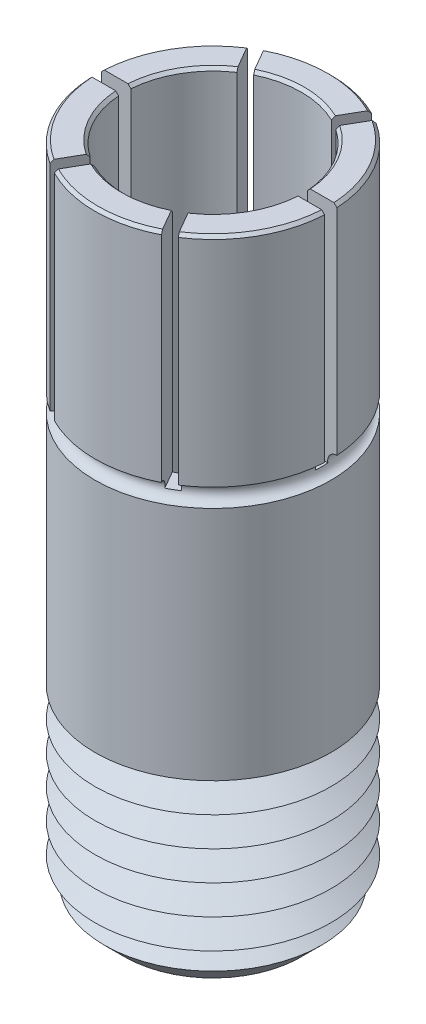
ISO-10303-21;
HEADER;
FILE_DESCRIPTION(('STEP AP214'),'2;1');
FILE_NAME('part.step','',(''),(''),'','','');
FILE_SCHEMA(('AUTOMOTIVE_DESIGN { 1 0 10303 214 1 1 1 1 }'));
ENDSEC;
DATA;
#1=APPLICATION_CONTEXT('core data for automotive mechanical design processes');
#2=APPLICATION_PROTOCOL_DEFINITION('international standard','automotive_design',2000,#1);
#3=PRODUCT_CONTEXT('',#1,'mechanical');
#4=PRODUCT('Part','Part','',(#3));
#5=PRODUCT_RELATED_PRODUCT_CATEGORY('part','',(#4));
#6=PRODUCT_DEFINITION_FORMATION('','',#4);
#7=PRODUCT_DEFINITION_CONTEXT('part definition',#1,'design');
#8=PRODUCT_DEFINITION('design','',#6,#7);
#9=PRODUCT_DEFINITION_SHAPE('','',#8);
#10=(LENGTH_UNIT() NAMED_UNIT(*) SI_UNIT(.MILLI.,.METRE.));
#11=(NAMED_UNIT(*) PLANE_ANGLE_UNIT() SI_UNIT($,.RADIAN.));
#12=(NAMED_UNIT(*) SI_UNIT($,.STERADIAN.) SOLID_ANGLE_UNIT());
#13=UNCERTAINTY_MEASURE_WITH_UNIT(LENGTH_MEASURE(1.E-05),#10,'distance_accuracy_value','');
#14=(GEOMETRIC_REPRESENTATION_CONTEXT(3) GLOBAL_UNCERTAINTY_ASSIGNED_CONTEXT((#13)) GLOBAL_UNIT_ASSIGNED_CONTEXT((#10,
#11,#12)) REPRESENTATION_CONTEXT('',''));
#15=CARTESIAN_POINT('',(0.,0.,0.));
#16=DIRECTION('',(0.,0.,1.));
#17=DIRECTION('',(1.,0.,0.));
#18=AXIS2_PLACEMENT_3D('',#15,#16,#17);
#19=CARTESIAN_POINT('',(0.,63.0319188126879,0.));
#20=DIRECTION('',(0.,1.,0.));
#21=DIRECTION('',(0.,0.,1.));
#22=AXIS2_PLACEMENT_3D('',#19,#20,#21);
#23=CYLINDRICAL_SURFACE('',#22,8.);
#24=CARTESIAN_POINT('',(0.,-9.17469319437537,0.));
#25=DIRECTION('',(0.,1.,0.));
#26=DIRECTION('',(0.,0.,1.));
#27=AXIS2_PLACEMENT_3D('',#24,#25,#26);
#28=CIRCLE('',#27,8.);
#29=CARTESIAN_POINT('',(0.,-9.17469319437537,8.));
#30=VERTEX_POINT('',#29);
#31=EDGE_CURVE('E1062',#30,#30,#28,.T.);
#32=ORIENTED_EDGE('',*,*,#31,.F.);
#33=EDGE_LOOP('',(#32));
#34=FACE_BOUND('',#33,.T.);
#35=CARTESIAN_POINT('',(0.,-25.1746931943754,0.));
#36=DIRECTION('',(0.,1.,0.));
#37=DIRECTION('',(0.,0.,1.));
#38=AXIS2_PLACEMENT_3D('',#35,#36,#37);
#39=CIRCLE('',#38,8.);
#40=CARTESIAN_POINT('',(0.,-25.1746931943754,8.));
#41=VERTEX_POINT('',#40);
#42=EDGE_CURVE('E769',#41,#41,#39,.T.);
#43=ORIENTED_EDGE('',*,*,#42,.T.);
#44=EDGE_LOOP('',(#43));
#45=FACE_BOUND('',#44,.T.);
#46=ADVANCED_FACE('F38',(#34,#45),#23,.T.);
#47=CARTESIAN_POINT('',(0.,6.82530680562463,8.));
#48=DIRECTION('',(0.,1.,0.));
#49=DIRECTION('',(0.,0.,1.));
#50=AXIS2_PLACEMENT_3D('',#47,#48,#49);
#51=PLANE('',#50);
#52=DIRECTION('',(-0.50000000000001,0.,0.866025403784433));
#53=VECTOR('',#52,1.);
#54=CARTESIAN_POINT('',(-2.85214823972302,6.82530680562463,4.10673232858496));
#55=LINE('',#54,#53);
#56=CARTESIAN_POINT('',(-3.45383554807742,6.82530680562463,5.14888531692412));
#57=VERTEX_POINT('',#56);
#58=CARTESIAN_POINT('',(-4.25527548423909,6.82530680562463,6.53702000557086));
#59=VERTEX_POINT('',#58);
#60=EDGE_CURVE('E764',#57,#59,#55,.T.);
#61=ORIENTED_EDGE('',*,*,#60,.F.);
#62=CARTESIAN_POINT('',(0.,6.82530680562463,0.));
#63=DIRECTION('',(0.,1.,0.));
#64=DIRECTION('',(0.,0.,1.));
#65=AXIS2_PLACEMENT_3D('',#62,#63,#64);
#66=CIRCLE('',#65,6.20000000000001);
#67=CARTESIAN_POINT('',(-6.1859832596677,6.82530680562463,0.41666666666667));
#68=VERTEX_POINT('',#67);
#69=EDGE_CURVE('E350',#57,#68,#66,.F.);
#70=ORIENTED_EDGE('',*,*,#69,.T.);
#71=DIRECTION('',(1.,0.,0.));
#72=VECTOR('',#71,1.);
#73=CARTESIAN_POINT('',(-4.98260864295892,6.82530680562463,0.41666666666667));
#74=LINE('',#73,#72);
#75=CARTESIAN_POINT('',(-7.78886313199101,6.82530680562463,0.41666666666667));
#76=VERTEX_POINT('',#75);
#77=EDGE_CURVE('E854',#76,#68,#74,.T.);
#78=ORIENTED_EDGE('',*,*,#77,.F.);
#79=CARTESIAN_POINT('',(0.,6.82530680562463,0.));
#80=DIRECTION('',(0.,1.,0.));
#81=DIRECTION('',(0.,0.,1.));
#82=AXIS2_PLACEMENT_3D('',#79,#80,#81);
#83=CIRCLE('',#82,7.79999999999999);
#84=EDGE_CURVE('E341',#76,#59,#83,.T.);
#85=ORIENTED_EDGE('',*,*,#84,.T.);
#86=EDGE_LOOP('',(#61,#70,#78,#85));
#87=FACE_BOUND('',#86,.T.);
#88=ADVANCED_FACE('F1054',(#87),#51,.T.);
#89=DIRECTION('',(0.50000000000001,0.,-0.866025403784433));
#90=VECTOR('',#89,1.);
#91=CARTESIAN_POINT('',(-2.13046040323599,6.82530680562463,4.52339899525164));
#92=LINE('',#91,#90);
#93=CARTESIAN_POINT('',(-3.53358764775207,6.82530680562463,6.95368667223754));
#94=VERTEX_POINT('',#93);
#95=CARTESIAN_POINT('',(-2.73214771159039,6.82530680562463,5.5655519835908));
#96=VERTEX_POINT('',#95);
#97=EDGE_CURVE('E55',#94,#96,#92,.T.);
#98=ORIENTED_EDGE('',*,*,#97,.F.);
#99=CARTESIAN_POINT('',(3.53358764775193,6.82530680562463,6.9536866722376));
#100=VERTEX_POINT('',#99);
#101=EDGE_CURVE('E355',#94,#100,#83,.T.);
#102=ORIENTED_EDGE('',*,*,#101,.T.);
#103=DIRECTION('',(0.499999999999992,0.,0.866025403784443));
#104=VECTOR('',#103,1.);
#105=CARTESIAN_POINT('',(2.1304604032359,6.82530680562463,4.52339899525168));
#106=LINE('',#105,#104);
#107=CARTESIAN_POINT('',(2.73214771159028,6.82530680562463,5.56555198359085));
#108=VERTEX_POINT('',#107);
#109=EDGE_CURVE('E960',#108,#100,#106,.T.);
#110=ORIENTED_EDGE('',*,*,#109,.F.);
#111=EDGE_CURVE('E897',#108,#96,#66,.F.);
#112=ORIENTED_EDGE('',*,*,#111,.T.);
#113=EDGE_LOOP('',(#98,#102,#110,#112));
#114=FACE_BOUND('',#113,.T.);
#115=ADVANCED_FACE('F959',(#114),#51,.T.);
#116=DIRECTION('',(-0.499999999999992,0.,-0.866025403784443));
#117=VECTOR('',#116,1.);
#118=CARTESIAN_POINT('',(2.85214823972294,6.82530680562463,4.10673232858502));
#119=LINE('',#118,#117);
#120=CARTESIAN_POINT('',(4.25527548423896,6.82530680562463,6.53702000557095));
#121=VERTEX_POINT('',#120);
#122=CARTESIAN_POINT('',(3.45383554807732,6.82530680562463,5.14888531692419));
#123=VERTEX_POINT('',#122);
#124=EDGE_CURVE('E63',#121,#123,#119,.T.);
#125=ORIENTED_EDGE('',*,*,#124,.F.);
#126=CARTESIAN_POINT('',(7.78886313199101,6.82530680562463,0.416666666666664));
#127=VERTEX_POINT('',#126);
#128=EDGE_CURVE('E367',#121,#127,#83,.T.);
#129=ORIENTED_EDGE('',*,*,#128,.T.);
#130=DIRECTION('',(1.,0.,0.));
#131=VECTOR('',#130,1.);
#132=CARTESIAN_POINT('',(4.98260864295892,6.82530680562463,0.416666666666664));
#133=LINE('',#132,#131);
#134=CARTESIAN_POINT('',(6.1859832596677,6.82530680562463,0.416666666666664));
#135=VERTEX_POINT('',#134);
#136=EDGE_CURVE('E717',#135,#127,#133,.T.);
#137=ORIENTED_EDGE('',*,*,#136,.F.);
#138=EDGE_CURVE('E899',#135,#123,#66,.F.);
#139=ORIENTED_EDGE('',*,*,#138,.T.);
#140=EDGE_LOOP('',(#125,#129,#137,#139));
#141=FACE_BOUND('',#140,.T.);
#142=ADVANCED_FACE('F1483',(#141),#51,.T.);
#143=DIRECTION('',(-1.,0.,0.));
#144=VECTOR('',#143,1.);
#145=CARTESIAN_POINT('',(4.98260864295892,6.82530680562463,-0.41666666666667));
#146=LINE('',#145,#144);
#147=CARTESIAN_POINT('',(7.78886313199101,6.82530680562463,-0.41666666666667));
#148=VERTEX_POINT('',#147);
#149=CARTESIAN_POINT('',(6.1859832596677,6.82530680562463,-0.41666666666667));
#150=VERTEX_POINT('',#149);
#151=EDGE_CURVE('E391',#148,#150,#146,.T.);
#152=ORIENTED_EDGE('',*,*,#151,.F.);
#153=CARTESIAN_POINT('',(4.25527548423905,6.82530680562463,-6.53702000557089));
#154=VERTEX_POINT('',#153);
#155=EDGE_CURVE('E346',#148,#154,#83,.T.);
#156=ORIENTED_EDGE('',*,*,#155,.T.);
#157=DIRECTION('',(0.500000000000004,0.,-0.866025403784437));
#158=VECTOR('',#157,1.);
#159=CARTESIAN_POINT('',(2.85214823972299,6.82530680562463,-4.10673232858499));
#160=LINE('',#159,#158);
#161=CARTESIAN_POINT('',(3.45383554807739,6.82530680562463,-5.14888531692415));
#162=VERTEX_POINT('',#161);
#163=EDGE_CURVE('E389',#162,#154,#160,.T.);
#164=ORIENTED_EDGE('',*,*,#163,.F.);
#165=EDGE_CURVE('E892',#162,#150,#66,.F.);
#166=ORIENTED_EDGE('',*,*,#165,.T.);
#167=EDGE_LOOP('',(#152,#156,#164,#166));
#168=FACE_BOUND('',#167,.T.);
#169=ADVANCED_FACE('F387',(#168),#51,.T.);
#170=DIRECTION('',(-0.500000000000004,0.,0.866025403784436));
#171=VECTOR('',#170,1.);
#172=CARTESIAN_POINT('',(2.13046040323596,6.82530680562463,-4.52339899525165));
#173=LINE('',#172,#171);
#174=CARTESIAN_POINT('',(3.53358764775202,6.82530680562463,-6.95368667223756));
#175=VERTEX_POINT('',#174);
#176=CARTESIAN_POINT('',(2.73214771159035,6.82530680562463,-5.56555198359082));
#177=VERTEX_POINT('',#176);
#178=EDGE_CURVE('E893',#175,#177,#173,.T.);
#179=ORIENTED_EDGE('',*,*,#178,.F.);
#180=CARTESIAN_POINT('',(-3.53358764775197,6.82530680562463,-6.95368667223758));
#181=VERTEX_POINT('',#180);
#182=EDGE_CURVE('E339',#175,#181,#83,.T.);
#183=ORIENTED_EDGE('',*,*,#182,.T.);
#184=DIRECTION('',(-0.499999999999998,0.,-0.86602540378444));
#185=VECTOR('',#184,1.);
#186=CARTESIAN_POINT('',(-2.13046040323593,6.82530680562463,-4.52339899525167));
#187=LINE('',#186,#185);
#188=CARTESIAN_POINT('',(-2.73214771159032,6.82530680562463,-5.56555198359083));
#189=VERTEX_POINT('',#188);
#190=EDGE_CURVE('E332',#189,#181,#187,.T.);
#191=ORIENTED_EDGE('',*,*,#190,.F.);
#192=EDGE_CURVE('E348',#189,#177,#66,.F.);
#193=ORIENTED_EDGE('',*,*,#192,.T.);
#194=EDGE_LOOP('',(#179,#183,#191,#193));
#195=FACE_BOUND('',#194,.T.);
#196=ADVANCED_FACE('F1366',(#195),#51,.T.);
#197=CARTESIAN_POINT('',(0.,63.0319188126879,0.));
#198=DIRECTION('',(0.,1.,0.));
#199=DIRECTION('',(0.,0.,1.));
#200=AXIS2_PLACEMENT_3D('',#197,#198,#199);
#201=CYLINDRICAL_SURFACE('',#200,8.);
#202=DIRECTION('',(0.,1.,0.));
#203=VECTOR('',#202,1.);
#204=CARTESIAN_POINT('',(-4.35541488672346,-8.67469319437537,6.71046653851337));
#205=LINE('',#204,#203);
#206=CARTESIAN_POINT('',(-4.35541488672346,-7.92469319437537,6.71046653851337));
#207=VERTEX_POINT('',#206);
#208=CARTESIAN_POINT('',(-4.35541488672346,6.62530680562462,6.71046653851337));
#209=VERTEX_POINT('',#208);
#210=EDGE_CURVE('E762',#207,#209,#205,.T.);
#211=ORIENTED_EDGE('',*,*,#210,.T.);
#212=CARTESIAN_POINT('',(0.,6.62530680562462,0.));
#213=DIRECTION('',(0.,1.,0.));
#214=DIRECTION('',(0.,0.,1.));
#215=AXIS2_PLACEMENT_3D('',#212,#213,#214);
#216=CIRCLE('',#215,8.);
#217=CARTESIAN_POINT('',(-7.98914193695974,6.62530680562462,0.41666666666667));
#218=VERTEX_POINT('',#217);
#219=EDGE_CURVE('E354',#209,#218,#216,.F.);
#220=ORIENTED_EDGE('',*,*,#219,.T.);
#221=DIRECTION('',(0.,1.,0.));
#222=VECTOR('',#221,1.);
#223=CARTESIAN_POINT('',(-7.98914193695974,-8.67469319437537,0.41666666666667));
#224=LINE('',#223,#222);
#225=CARTESIAN_POINT('',(-7.98914193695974,-7.92469319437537,0.41666666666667));
#226=VERTEX_POINT('',#225);
#227=EDGE_CURVE('E843',#226,#218,#224,.T.);
#228=ORIENTED_EDGE('',*,*,#227,.F.);
#229=CARTESIAN_POINT('',(0.,-7.92469319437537,0.));
#230=DIRECTION('',(0.,1.,0.));
#231=DIRECTION('',(0.,0.,1.));
#232=AXIS2_PLACEMENT_3D('',#229,#230,#231);
#233=CIRCLE('',#232,8.);
#234=EDGE_CURVE('E1608',#226,#207,#233,.T.);
#235=ORIENTED_EDGE('',*,*,#234,.T.);
#236=EDGE_LOOP('',(#211,#220,#228,#235));
#237=FACE_BOUND('',#236,.T.);
#238=ADVANCED_FACE('F1358',(#237),#201,.T.);
#239=DIRECTION('',(0.,1.,0.));
#240=VECTOR('',#239,1.);
#241=CARTESIAN_POINT('',(-3.63372705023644,-8.67469319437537,7.12713320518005));
#242=LINE('',#241,#240);
#243=CARTESIAN_POINT('',(-3.63372705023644,-7.92469319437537,7.12713320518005));
#244=VERTEX_POINT('',#243);
#245=CARTESIAN_POINT('',(-3.63372705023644,6.62530680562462,7.12713320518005));
#246=VERTEX_POINT('',#245);
#247=EDGE_CURVE('E757',#244,#246,#242,.T.);
#248=ORIENTED_EDGE('',*,*,#247,.F.);
#249=CARTESIAN_POINT('',(3.63372705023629,-7.92469319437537,7.12713320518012));
#250=VERTEX_POINT('',#249);
#251=EDGE_CURVE('E1611',#244,#250,#233,.T.);
#252=ORIENTED_EDGE('',*,*,#251,.T.);
#253=DIRECTION('',(0.,1.,0.));
#254=VECTOR('',#253,1.);
#255=CARTESIAN_POINT('',(3.63372705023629,-8.67469319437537,7.12713320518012));
#256=LINE('',#255,#254);
#257=CARTESIAN_POINT('',(3.63372705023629,6.62530680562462,7.12713320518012));
#258=VERTEX_POINT('',#257);
#259=EDGE_CURVE('E954',#250,#258,#256,.T.);
#260=ORIENTED_EDGE('',*,*,#259,.T.);
#261=EDGE_CURVE('E363',#258,#246,#216,.F.);
#262=ORIENTED_EDGE('',*,*,#261,.T.);
#263=EDGE_LOOP('',(#248,#252,#260,#262));
#264=FACE_BOUND('',#263,.T.);
#265=ADVANCED_FACE('F951',(#264),#201,.T.);
#266=DIRECTION('',(0.,1.,0.));
#267=VECTOR('',#266,1.);
#268=CARTESIAN_POINT('',(4.35541488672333,-8.67469319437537,6.71046653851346));
#269=LINE('',#268,#267);
#270=CARTESIAN_POINT('',(4.35541488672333,-7.92469319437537,6.71046653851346));
#271=VERTEX_POINT('',#270);
#272=CARTESIAN_POINT('',(4.35541488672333,6.62530680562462,6.71046653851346));
#273=VERTEX_POINT('',#272);
#274=EDGE_CURVE('E970',#271,#273,#269,.T.);
#275=ORIENTED_EDGE('',*,*,#274,.F.);
#276=CARTESIAN_POINT('',(7.98914193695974,-7.92469319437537,0.416666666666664));
#277=VERTEX_POINT('',#276);
#278=EDGE_CURVE('E1668',#271,#277,#233,.T.);
#279=ORIENTED_EDGE('',*,*,#278,.T.);
#280=DIRECTION('',(0.,1.,0.));
#281=VECTOR('',#280,1.);
#282=CARTESIAN_POINT('',(7.98914193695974,-8.67469319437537,0.416666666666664));
#283=LINE('',#282,#281);
#284=CARTESIAN_POINT('',(7.98914193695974,6.62530680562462,0.416666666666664));
#285=VERTEX_POINT('',#284);
#286=EDGE_CURVE('E895',#277,#285,#283,.T.);
#287=ORIENTED_EDGE('',*,*,#286,.T.);
#288=EDGE_CURVE('E936',#285,#273,#216,.F.);
#289=ORIENTED_EDGE('',*,*,#288,.T.);
#290=EDGE_LOOP('',(#275,#279,#287,#289));
#291=FACE_BOUND('',#290,.T.);
#292=ADVANCED_FACE('F1450',(#291),#201,.T.);
#293=DIRECTION('',(0.,1.,0.));
#294=VECTOR('',#293,1.);
#295=CARTESIAN_POINT('',(7.98914193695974,-8.67469319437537,-0.41666666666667));
#296=LINE('',#295,#294);
#297=CARTESIAN_POINT('',(7.98914193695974,-7.92469319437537,-0.41666666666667));
#298=VERTEX_POINT('',#297);
#299=CARTESIAN_POINT('',(7.98914193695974,6.62530680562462,-0.41666666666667));
#300=VERTEX_POINT('',#299);
#301=EDGE_CURVE('E977',#298,#300,#296,.T.);
#302=ORIENTED_EDGE('',*,*,#301,.F.);
#303=CARTESIAN_POINT('',(4.35541488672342,-7.92469319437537,-6.7104665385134));
#304=VERTEX_POINT('',#303);
#305=EDGE_CURVE('E1665',#298,#304,#233,.T.);
#306=ORIENTED_EDGE('',*,*,#305,.T.);
#307=DIRECTION('',(0.,1.,0.));
#308=VECTOR('',#307,1.);
#309=CARTESIAN_POINT('',(4.35541488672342,-8.67469319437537,-6.7104665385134));
#310=LINE('',#309,#308);
#311=CARTESIAN_POINT('',(4.35541488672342,6.62530680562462,-6.7104665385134));
#312=VERTEX_POINT('',#311);
#313=EDGE_CURVE('E333',#304,#312,#310,.T.);
#314=ORIENTED_EDGE('',*,*,#313,.T.);
#315=EDGE_CURVE('E400',#312,#300,#216,.F.);
#316=ORIENTED_EDGE('',*,*,#315,.T.);
#317=EDGE_LOOP('',(#302,#306,#314,#316));
#318=FACE_BOUND('',#317,.T.);
#319=ADVANCED_FACE('F1443',(#318),#201,.T.);
#320=DIRECTION('',(0.,1.,0.));
#321=VECTOR('',#320,1.);
#322=CARTESIAN_POINT('',(3.63372705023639,-8.67469319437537,-7.12713320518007));
#323=LINE('',#322,#321);
#324=CARTESIAN_POINT('',(3.63372705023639,-7.92469319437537,-7.12713320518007));
#325=VERTEX_POINT('',#324);
#326=CARTESIAN_POINT('',(3.63372705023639,6.62530680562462,-7.12713320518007));
#327=VERTEX_POINT('',#326);
#328=EDGE_CURVE('E985',#325,#327,#323,.T.);
#329=ORIENTED_EDGE('',*,*,#328,.F.);
#330=CARTESIAN_POINT('',(-3.63372705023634,-7.92469319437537,-7.12713320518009));
#331=VERTEX_POINT('',#330);
#332=EDGE_CURVE('E1664',#325,#331,#233,.T.);
#333=ORIENTED_EDGE('',*,*,#332,.T.);
#334=DIRECTION('',(0.,1.,0.));
#335=VECTOR('',#334,1.);
#336=CARTESIAN_POINT('',(-3.63372705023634,-8.67469319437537,-7.12713320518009));
#337=LINE('',#336,#335);
#338=CARTESIAN_POINT('',(-3.63372705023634,6.62530680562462,-7.12713320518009));
#339=VERTEX_POINT('',#338);
#340=EDGE_CURVE('E785',#331,#339,#337,.T.);
#341=ORIENTED_EDGE('',*,*,#340,.T.);
#342=EDGE_CURVE('E925',#339,#327,#216,.F.);
#343=ORIENTED_EDGE('',*,*,#342,.T.);
#344=EDGE_LOOP('',(#329,#333,#341,#343));
#345=FACE_BOUND('',#344,.T.);
#346=ADVANCED_FACE('F1359',(#345),#201,.T.);
#347=CARTESIAN_POINT('',(0.,6.82530680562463,0.));
#348=DIRECTION('',(0.,-1.,0.));
#349=DIRECTION('',(0.,0.,-1.));
#350=AXIS2_PLACEMENT_3D('',#347,#348,#349);
#351=CONICAL_SURFACE('',#350,7.79999999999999,0.785398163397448);
#352=CARTESIAN_POINT('',(-4.25517534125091,6.82550680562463,6.5368465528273));
#353=CARTESIAN_POINT('',(-4.27189891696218,6.79210739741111,6.56581263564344));
#354=CARTESIAN_POINT('',(-4.28862234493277,6.75870769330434,6.59477846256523));
#355=CARTESIAN_POINT('',(-4.32206890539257,6.69190769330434,6.65270960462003));
#356=CARTESIAN_POINT('',(-4.33879203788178,6.65850739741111,6.68167491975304));
#357=CARTESIAN_POINT('',(-4.35551502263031,6.62510680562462,6.7106399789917));
#358=B_SPLINE_CURVE_WITH_KNOTS('',3,(#352,#353,#354,#355,#356,#357),.UNSPECIFIED.,.F.,.F.,(4,2,
4),(0.,0.141803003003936,0.283606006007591),.UNSPECIFIED.);
#359=EDGE_CURVE('E882',#59,#209,#358,.T.);
#360=ORIENTED_EDGE('',*,*,#359,.F.);
#361=ORIENTED_EDGE('',*,*,#84,.F.);
#362=CARTESIAN_POINT('',(-11.6029732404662,3.01485465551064,0.41666666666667));
#363=CARTESIAN_POINT('',(-10.961063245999,3.6563292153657,0.41666666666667));
#364=CARTESIAN_POINT('',(-10.3191387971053,4.29778934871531,0.41666666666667));
#365=CARTESIAN_POINT('',(-9.03516708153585,5.58058638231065,0.41666666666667));
#366=CARTESIAN_POINT('',(-8.39311981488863,6.22192328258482,0.41666666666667));
#367=CARTESIAN_POINT('',(-7.42988603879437,7.18376575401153,0.41666666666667));
#368=CARTESIAN_POINT('',(-7.10878091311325,7.50435281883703,0.41666666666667));
#369=CARTESIAN_POINT('',(-6.46648514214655,8.14544122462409,0.41666666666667));
#370=CARTESIAN_POINT('',(-6.14529449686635,8.46594256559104,0.41666666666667));
#371=CARTESIAN_POINT('',(-5.50278662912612,9.10681857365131,0.41666666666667));
#372=CARTESIAN_POINT('',(-5.18146940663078,9.42719324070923,0.41666666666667));
#373=CARTESIAN_POINT('',(-4.53859365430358,10.0677004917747,0.41666666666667));
#374=CARTESIAN_POINT('',(-4.2170351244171,10.3878330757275,0.41666666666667));
#375=CARTESIAN_POINT('',(-3.89529860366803,10.70778688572,0.41666666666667));
#376=B_SPLINE_CURVE_WITH_KNOTS('',3,(#362,#363,#364,#365,#366,#367,#368,#369,#370,#371,#372,
#373,#374,#375),.UNSPECIFIED.,.F.,.F.,(4,2,2,2,2,2,4),(0.,2.7224699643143,5.44493929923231,
6.80617442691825,8.16740946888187,9.52864489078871,10.8898806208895),.UNSPECIFIED.);
#377=EDGE_CURVE('E824',#218,#76,#376,.T.);
#378=ORIENTED_EDGE('',*,*,#377,.F.);
#379=ORIENTED_EDGE('',*,*,#219,.F.);
#380=EDGE_LOOP('',(#360,#361,#378,#379));
#381=FACE_BOUND('',#380,.T.);
#382=ADVANCED_FACE('F1339',(#381),#351,.T.);
#383=CARTESIAN_POINT('',(-3.63382718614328,6.62510680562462,7.12730664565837));
#384=CARTESIAN_POINT('',(-3.61710420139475,6.65850739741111,7.09834158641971));
#385=CARTESIAN_POINT('',(-3.60038106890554,6.69190769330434,7.0693762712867));
#386=CARTESIAN_POINT('',(-3.56693450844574,6.75870769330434,7.0114451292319));
#387=CARTESIAN_POINT('',(-3.55021108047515,6.79210739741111,6.98247930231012));
#388=CARTESIAN_POINT('',(-3.53348750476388,6.82550680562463,6.95351321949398));
#389=B_SPLINE_CURVE_WITH_KNOTS('',3,(#383,#384,#385,#386,#387,#388),.UNSPECIFIED.,.F.,.F.,(4,2,
4),(0.,0.141803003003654,0.283606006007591),.UNSPECIFIED.);
#390=EDGE_CURVE('E546',#246,#94,#389,.T.);
#391=ORIENTED_EDGE('',*,*,#390,.F.);
#392=ORIENTED_EDGE('',*,*,#261,.F.);
#393=CARTESIAN_POINT('',(3.53348750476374,6.82550680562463,6.95351321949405));
#394=CARTESIAN_POINT('',(3.55021108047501,6.79210739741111,6.98247930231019));
#395=CARTESIAN_POINT('',(3.5669345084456,6.75870769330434,7.01144512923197));
#396=CARTESIAN_POINT('',(3.6003810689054,6.69190769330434,7.06937627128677));
#397=CARTESIAN_POINT('',(3.61710420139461,6.65850739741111,7.09834158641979));
#398=CARTESIAN_POINT('',(3.63382718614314,6.62510680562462,7.12730664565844));
#399=B_SPLINE_CURVE_WITH_KNOTS('',3,(#393,#394,#395,#396,#397,#398),.UNSPECIFIED.,.F.,.F.,(4,2,
4),(0.,0.141803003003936,0.283606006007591),.UNSPECIFIED.);
#400=EDGE_CURVE('E636',#100,#258,#399,.T.);
#401=ORIENTED_EDGE('',*,*,#400,.F.);
#402=ORIENTED_EDGE('',*,*,#101,.F.);
#403=EDGE_LOOP('',(#391,#392,#401,#402));
#404=FACE_BOUND('',#403,.T.);
#405=ADVANCED_FACE('F958',(#404),#351,.T.);
#406=CARTESIAN_POINT('',(4.35551502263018,6.62510680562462,6.71063997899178));
#407=CARTESIAN_POINT('',(4.33879203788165,6.65850739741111,6.68167491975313));
#408=CARTESIAN_POINT('',(4.32206890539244,6.69190769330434,6.65270960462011));
#409=CARTESIAN_POINT('',(4.28862234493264,6.75870769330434,6.59477846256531));
#410=CARTESIAN_POINT('',(4.27189891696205,6.79210739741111,6.56581263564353));
#411=CARTESIAN_POINT('',(4.25517534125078,6.82550680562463,6.53684655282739));
#412=B_SPLINE_CURVE_WITH_KNOTS('',3,(#406,#407,#408,#409,#410,#411),.UNSPECIFIED.,.F.,.F.,(4,2,
4),(0.,0.141803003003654,0.283606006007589),.UNSPECIFIED.);
#413=EDGE_CURVE('E654',#273,#121,#412,.T.);
#414=ORIENTED_EDGE('',*,*,#413,.F.);
#415=ORIENTED_EDGE('',*,*,#288,.F.);
#416=CARTESIAN_POINT('',(3.89529860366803,10.70778688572,0.416666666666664));
#417=CARTESIAN_POINT('',(4.1665037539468,10.438096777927,0.416666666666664));
#418=CARTESIAN_POINT('',(4.43757504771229,10.1682722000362,0.416666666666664));
#419=CARTESIAN_POINT('',(4.97953103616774,9.62843579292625,0.416666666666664));
#420=CARTESIAN_POINT('',(5.25041573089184,9.3584239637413,0.416666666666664));
#421=CARTESIAN_POINT('',(6.06291160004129,8.54823012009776,0.416666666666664));
#422=CARTESIAN_POINT('',(6.60436469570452,8.00788961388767,0.416666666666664));
#423=CARTESIAN_POINT('',(7.34748010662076,7.26603007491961,0.416666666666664));
#424=CARTESIAN_POINT('',(7.54922748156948,7.06459621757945,0.416666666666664));
#425=CARTESIAN_POINT('',(8.3931206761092,6.22192392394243,0.416666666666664));
#426=CARTESIAN_POINT('',(9.0351676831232,5.58058653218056,0.416666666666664));
#427=CARTESIAN_POINT('',(10.3191386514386,4.29778874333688,0.416666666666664));
#428=CARTESIAN_POINT('',(10.9610626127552,3.65632834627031,0.416666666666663));
#429=CARTESIAN_POINT('',(11.6029732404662,3.01485465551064,0.416666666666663));
#430=B_SPLINE_CURVE_WITH_KNOTS('',3,(#416,#417,#418,#419,#420,#421,#422,#423,#424,#425,#426,
#427,#428,#429),.UNSPECIFIED.,.F.,.F.,(4,2,2,2,2,2,4),(0.,1.14741643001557,2.29483265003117,
4.58966451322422,5.4449413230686,8.16741114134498,10.8898806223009),.UNSPECIFIED.);
#431=EDGE_CURVE('E667',#127,#285,#430,.T.);
#432=ORIENTED_EDGE('',*,*,#431,.F.);
#433=ORIENTED_EDGE('',*,*,#128,.F.);
#434=EDGE_LOOP('',(#414,#415,#432,#433));
#435=FACE_BOUND('',#434,.T.);
#436=ADVANCED_FACE('F1416',(#435),#351,.T.);
#437=CARTESIAN_POINT('',(11.6029732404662,3.01485465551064,-0.41666666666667));
#438=CARTESIAN_POINT('',(10.961063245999,3.6563292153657,-0.41666666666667));
#439=CARTESIAN_POINT('',(10.3191387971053,4.29778934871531,-0.41666666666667));
#440=CARTESIAN_POINT('',(9.03516708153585,5.58058638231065,-0.41666666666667));
#441=CARTESIAN_POINT('',(8.39311981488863,6.22192328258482,-0.41666666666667));
#442=CARTESIAN_POINT('',(7.42988603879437,7.18376575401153,-0.41666666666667));
#443=CARTESIAN_POINT('',(7.10878091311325,7.50435281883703,-0.41666666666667));
#444=CARTESIAN_POINT('',(6.46648514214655,8.14544122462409,-0.41666666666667));
#445=CARTESIAN_POINT('',(6.14529449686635,8.46594256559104,-0.41666666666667));
#446=CARTESIAN_POINT('',(5.50278662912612,9.10681857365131,-0.41666666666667));
#447=CARTESIAN_POINT('',(5.18146940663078,9.42719324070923,-0.41666666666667));
#448=CARTESIAN_POINT('',(4.53859365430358,10.0677004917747,-0.41666666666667));
#449=CARTESIAN_POINT('',(4.2170351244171,10.3878330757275,-0.41666666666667));
#450=CARTESIAN_POINT('',(3.89529860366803,10.70778688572,-0.41666666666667));
#451=B_SPLINE_CURVE_WITH_KNOTS('',3,(#437,#438,#439,#440,#441,#442,#443,#444,#445,#446,#447,
#448,#449,#450),.UNSPECIFIED.,.F.,.F.,(4,2,2,2,2,2,4),(0.,2.7224699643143,5.44493929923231,
6.80617442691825,8.16740946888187,9.52864489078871,10.8898806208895),.UNSPECIFIED.);
#452=EDGE_CURVE('E397',#300,#148,#451,.T.);
#453=ORIENTED_EDGE('',*,*,#452,.F.);
#454=ORIENTED_EDGE('',*,*,#315,.F.);
#455=CARTESIAN_POINT('',(4.25517534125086,6.82550680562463,-6.53684655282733));
#456=CARTESIAN_POINT('',(4.27189891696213,6.79210739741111,-6.56581263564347));
#457=CARTESIAN_POINT('',(4.28862234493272,6.75870769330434,-6.59477846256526));
#458=CARTESIAN_POINT('',(4.32206890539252,6.69190769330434,-6.65270960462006));
#459=CARTESIAN_POINT('',(4.33879203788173,6.65850739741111,-6.68167491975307));
#460=CARTESIAN_POINT('',(4.35551502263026,6.62510680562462,-6.71063997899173));
#461=B_SPLINE_CURVE_WITH_KNOTS('',3,(#455,#456,#457,#458,#459,#460),.UNSPECIFIED.,.F.,.F.,(4,2,
4),(0.,0.141803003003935,0.283606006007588),.UNSPECIFIED.);
#462=EDGE_CURVE('E399',#154,#312,#461,.T.);
#463=ORIENTED_EDGE('',*,*,#462,.F.);
#464=ORIENTED_EDGE('',*,*,#155,.F.);
#465=EDGE_LOOP('',(#453,#454,#463,#464));
#466=FACE_BOUND('',#465,.T.);
#467=ADVANCED_FACE('F395',(#466),#351,.T.);
#468=CARTESIAN_POINT('',(3.63382718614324,6.62510680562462,-7.1273066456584));
#469=CARTESIAN_POINT('',(3.6171042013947,6.65850739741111,-7.09834158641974));
#470=CARTESIAN_POINT('',(3.60038106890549,6.69190769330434,-7.06937627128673));
#471=CARTESIAN_POINT('',(3.56693450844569,6.75870769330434,-7.01144512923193));
#472=CARTESIAN_POINT('',(3.5502110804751,6.79210739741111,-6.98247930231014));
#473=CARTESIAN_POINT('',(3.53348750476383,6.82550680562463,-6.953513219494));
#474=B_SPLINE_CURVE_WITH_KNOTS('',3,(#468,#469,#470,#471,#472,#473),.UNSPECIFIED.,.F.,.F.,(4,2,
4),(0.,0.141803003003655,0.283606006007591),.UNSPECIFIED.);
#475=EDGE_CURVE('E1654',#327,#175,#474,.T.);
#476=ORIENTED_EDGE('',*,*,#475,.F.);
#477=ORIENTED_EDGE('',*,*,#342,.F.);
#478=CARTESIAN_POINT('',(-3.53348750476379,6.82550680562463,-6.95351321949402));
#479=CARTESIAN_POINT('',(-3.55021108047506,6.79210739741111,-6.98247930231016));
#480=CARTESIAN_POINT('',(-3.56693450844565,6.75870769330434,-7.01144512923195));
#481=CARTESIAN_POINT('',(-3.60038106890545,6.69190769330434,-7.06937627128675));
#482=CARTESIAN_POINT('',(-3.61710420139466,6.65850739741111,-7.09834158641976));
#483=CARTESIAN_POINT('',(-3.63382718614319,6.62510680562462,-7.12730664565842));
#484=B_SPLINE_CURVE_WITH_KNOTS('',3,(#478,#479,#480,#481,#482,#483),.UNSPECIFIED.,.F.,.F.,(4,2,
4),(0.,0.141803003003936,0.283606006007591),.UNSPECIFIED.);
#485=EDGE_CURVE('E1651',#181,#339,#484,.T.);
#486=ORIENTED_EDGE('',*,*,#485,.F.);
#487=ORIENTED_EDGE('',*,*,#182,.F.);
#488=EDGE_LOOP('',(#476,#477,#486,#487));
#489=FACE_BOUND('',#488,.T.);
#490=ADVANCED_FACE('F1340',(#489),#351,.T.);
#491=CARTESIAN_POINT('',(0.,6.62530680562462,0.));
#492=DIRECTION('',(0.,1.,0.));
#493=DIRECTION('',(0.,0.,1.));
#494=AXIS2_PLACEMENT_3D('',#491,#492,#493);
#495=CONICAL_SURFACE('',#494,6.,0.785398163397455);
#496=CARTESIAN_POINT('',(-3.35350113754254,6.62510680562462,4.97510102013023));
#497=CARTESIAN_POINT('',(-3.37024088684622,6.65850551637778,5.00409511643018));
#498=CARTESIAN_POINT('',(-3.38698031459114,6.69190487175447,5.03308865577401));
#499=CARTESIAN_POINT('',(-3.42045852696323,6.75870487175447,5.09107462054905));
#500=CARTESIAN_POINT('',(-3.43719731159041,6.79210551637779,5.12006704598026));
#501=CARTESIAN_POINT('',(-3.45393577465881,6.82550680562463,5.14905891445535));
#502=B_SPLINE_CURVE_WITH_KNOTS('',3,(#496,#497,#498,#499,#500,#501),.UNSPECIFIED.,.F.,.F.,(4,2,
4),(0.,0.141870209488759,0.283740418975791),.UNSPECIFIED.);
#503=CARTESIAN_POINT('',(-3.35360137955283,6.62530680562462,4.97527464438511));
#504=VERTEX_POINT('',#503);
#505=EDGE_CURVE('E528',#504,#57,#502,.T.);
#506=ORIENTED_EDGE('',*,*,#505,.F.);
#507=CARTESIAN_POINT('',(0.,6.62530680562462,0.));
#508=DIRECTION('',(0.,1.,0.));
#509=DIRECTION('',(0.,0.,1.));
#510=AXIS2_PLACEMENT_3D('',#507,#508,#509);
#511=CIRCLE('',#510,6.);
#512=CARTESIAN_POINT('',(-5.98551492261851,6.62530680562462,0.41666666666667));
#513=VERTEX_POINT('',#512);
#514=EDGE_CURVE('E920',#513,#504,#511,.T.);
#515=ORIENTED_EDGE('',*,*,#514,.F.);
#516=CARTESIAN_POINT('',(-7.67477285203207,8.31138184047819,0.41666666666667));
#517=CARTESIAN_POINT('',(-7.40681904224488,8.04382442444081,0.41666666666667));
#518=CARTESIAN_POINT('',(-7.13884705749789,7.77628520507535,0.41666666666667));
#519=CARTESIAN_POINT('',(-6.602844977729,7.24126504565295,0.41666666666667));
#520=CARTESIAN_POINT('',(-6.33481488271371,6.9737841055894,0.41666666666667));
#521=CARTESIAN_POINT('',(-5.79867473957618,6.43890230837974,0.41666666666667));
#522=CARTESIAN_POINT('',(-5.53056469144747,6.17150145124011,0.41666666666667));
#523=CARTESIAN_POINT('',(-4.99421422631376,5.63683046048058,0.41666666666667));
#524=CARTESIAN_POINT('',(-4.72597380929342,5.36956032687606,0.41666666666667));
#525=CARTESIAN_POINT('',(-4.45764302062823,5.10238089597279,0.41666666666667));
#526=B_SPLINE_CURVE_WITH_KNOTS('',3,(#516,#517,#518,#519,#520,#521,#522,#523,#524,#525),
.UNSPECIFIED.,.F.,.F.,(4,2,2,2,4),(0.,1.13599117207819,2.27198221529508,3.407973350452,
4.5439646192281),.UNSPECIFIED.);
#527=EDGE_CURVE('E470',#68,#513,#526,.T.);
#528=ORIENTED_EDGE('',*,*,#527,.F.);
#529=ORIENTED_EDGE('',*,*,#69,.F.);
#530=EDGE_LOOP('',(#506,#515,#528,#529));
#531=FACE_BOUND('',#530,.T.);
#532=ADVANCED_FACE('F465',(#531),#495,.F.);
#533=CARTESIAN_POINT('',(-2.73224793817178,6.82550680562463,5.56572558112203));
#534=CARTESIAN_POINT('',(-2.71550947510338,6.79210551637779,5.53673371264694));
#535=CARTESIAN_POINT('',(-2.6987706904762,6.75870487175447,5.50774128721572));
#536=CARTESIAN_POINT('',(-2.66529247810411,6.69190487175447,5.44975532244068));
#537=CARTESIAN_POINT('',(-2.6485530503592,6.65850551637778,5.42076178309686));
#538=CARTESIAN_POINT('',(-2.63181330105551,6.62510680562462,5.39176768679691));
#539=B_SPLINE_CURVE_WITH_KNOTS('',3,(#533,#534,#535,#536,#537,#538),.UNSPECIFIED.,.F.,.F.,(4,2,
4),(0.,0.141870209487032,0.283740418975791),.UNSPECIFIED.);
#540=CARTESIAN_POINT('',(-2.6319135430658,6.62530680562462,5.39194131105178));
#541=VERTEX_POINT('',#540);
#542=EDGE_CURVE('E522',#96,#541,#539,.T.);
#543=ORIENTED_EDGE('',*,*,#542,.F.);
#544=ORIENTED_EDGE('',*,*,#111,.F.);
#545=CARTESIAN_POINT('',(2.6318133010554,6.62510680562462,5.39176768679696));
#546=CARTESIAN_POINT('',(2.64855305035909,6.65850551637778,5.42076178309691));
#547=CARTESIAN_POINT('',(2.66529247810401,6.69190487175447,5.44975532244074));
#548=CARTESIAN_POINT('',(2.69877069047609,6.75870487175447,5.50774128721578));
#549=CARTESIAN_POINT('',(2.71550947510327,6.79210551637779,5.53673371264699));
#550=CARTESIAN_POINT('',(2.73224793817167,6.82550680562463,5.56572558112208));
#551=B_SPLINE_CURVE_WITH_KNOTS('',3,(#545,#546,#547,#548,#549,#550),.UNSPECIFIED.,.F.,.F.,(4,2,
4),(0.,0.14187020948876,0.283740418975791),.UNSPECIFIED.);
#552=CARTESIAN_POINT('',(2.63191354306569,6.62530680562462,5.39194131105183));
#553=VERTEX_POINT('',#552);
#554=EDGE_CURVE('E516',#553,#108,#551,.T.);
#555=ORIENTED_EDGE('',*,*,#554,.F.);
#556=EDGE_CURVE('E918',#541,#553,#511,.T.);
#557=ORIENTED_EDGE('',*,*,#556,.F.);
#558=EDGE_LOOP('',(#543,#544,#555,#557));
#559=FACE_BOUND('',#558,.T.);
#560=ADVANCED_FACE('F917',(#559),#495,.F.);
#561=CARTESIAN_POINT('',(3.45393577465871,6.82550680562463,5.14905891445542));
#562=CARTESIAN_POINT('',(3.4371973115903,6.79210551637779,5.12006704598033));
#563=CARTESIAN_POINT('',(3.42045852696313,6.75870487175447,5.09107462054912));
#564=CARTESIAN_POINT('',(3.38698031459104,6.69190487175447,5.03308865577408));
#565=CARTESIAN_POINT('',(3.37024088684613,6.65850551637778,5.00409511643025));
#566=CARTESIAN_POINT('',(3.35350113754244,6.62510680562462,4.9751010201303));
#567=B_SPLINE_CURVE_WITH_KNOTS('',3,(#561,#562,#563,#564,#565,#566),.UNSPECIFIED.,.F.,.F.,(4,2,
4),(0.,0.141870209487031,0.283740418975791),.UNSPECIFIED.);
#568=CARTESIAN_POINT('',(3.35360137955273,6.62530680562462,4.97527464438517));
#569=VERTEX_POINT('',#568);
#570=EDGE_CURVE('E510',#123,#569,#567,.T.);
#571=ORIENTED_EDGE('',*,*,#570,.F.);
#572=ORIENTED_EDGE('',*,*,#138,.F.);
#573=CARTESIAN_POINT('',(4.45764302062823,5.10238089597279,0.416666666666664));
#574=CARTESIAN_POINT('',(4.72597380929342,5.36956032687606,0.416666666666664));
#575=CARTESIAN_POINT('',(4.99421422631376,5.63683046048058,0.416666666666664));
#576=CARTESIAN_POINT('',(5.53056469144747,6.17150145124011,0.416666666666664));
#577=CARTESIAN_POINT('',(5.79867473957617,6.43890230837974,0.416666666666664));
#578=CARTESIAN_POINT('',(6.33481488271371,6.9737841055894,0.416666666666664));
#579=CARTESIAN_POINT('',(6.602844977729,7.24126504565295,0.416666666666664));
#580=CARTESIAN_POINT('',(7.13884705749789,7.77628520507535,0.416666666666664));
#581=CARTESIAN_POINT('',(7.40681904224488,8.04382442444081,0.416666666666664));
#582=CARTESIAN_POINT('',(7.67477285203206,8.31138184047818,0.416666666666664));
#583=B_SPLINE_CURVE_WITH_KNOTS('',3,(#573,#574,#575,#576,#577,#578,#579,#580,#581,#582),
.UNSPECIFIED.,.F.,.F.,(4,2,2,2,4),(0.,1.1359912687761,2.27198240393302,3.4079734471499,
4.5439646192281),.UNSPECIFIED.);
#584=CARTESIAN_POINT('',(5.98551492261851,6.62530680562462,0.416666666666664));
#585=VERTEX_POINT('',#584);
#586=EDGE_CURVE('E503',#585,#135,#583,.T.);
#587=ORIENTED_EDGE('',*,*,#586,.F.);
#588=EDGE_CURVE('E921',#569,#585,#511,.T.);
#589=ORIENTED_EDGE('',*,*,#588,.F.);
#590=EDGE_LOOP('',(#571,#572,#587,#589));
#591=FACE_BOUND('',#590,.T.);
#592=ADVANCED_FACE('F1381',(#591),#495,.F.);
#593=CARTESIAN_POINT('',(7.67477285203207,8.31138184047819,-0.41666666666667));
#594=CARTESIAN_POINT('',(7.40681904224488,8.04382442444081,-0.41666666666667));
#595=CARTESIAN_POINT('',(7.13884705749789,7.77628520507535,-0.41666666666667));
#596=CARTESIAN_POINT('',(6.602844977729,7.24126504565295,-0.41666666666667));
#597=CARTESIAN_POINT('',(6.33481488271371,6.9737841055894,-0.41666666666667));
#598=CARTESIAN_POINT('',(5.79867473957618,6.43890230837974,-0.41666666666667));
#599=CARTESIAN_POINT('',(5.53056469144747,6.17150145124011,-0.41666666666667));
#600=CARTESIAN_POINT('',(4.99421422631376,5.63683046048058,-0.41666666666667));
#601=CARTESIAN_POINT('',(4.72597380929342,5.36956032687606,-0.41666666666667));
#602=CARTESIAN_POINT('',(4.45764302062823,5.10238089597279,-0.41666666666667));
#603=B_SPLINE_CURVE_WITH_KNOTS('',3,(#593,#594,#595,#596,#597,#598,#599,#600,#601,#602),
.UNSPECIFIED.,.F.,.F.,(4,2,2,2,4),(0.,1.13599117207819,2.27198221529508,3.407973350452,
4.5439646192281),.UNSPECIFIED.);
#604=CARTESIAN_POINT('',(5.98551492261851,6.62530680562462,-0.41666666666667));
#605=VERTEX_POINT('',#604);
#606=EDGE_CURVE('E449',#150,#605,#603,.T.);
#607=ORIENTED_EDGE('',*,*,#606,.F.);
#608=ORIENTED_EDGE('',*,*,#165,.F.);
#609=CARTESIAN_POINT('',(3.3535011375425,6.62510680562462,-4.97510102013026));
#610=CARTESIAN_POINT('',(3.37024088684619,6.65850551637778,-5.00409511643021));
#611=CARTESIAN_POINT('',(3.38698031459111,6.69190487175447,-5.03308865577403));
#612=CARTESIAN_POINT('',(3.4204585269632,6.75870487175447,-5.09107462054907));
#613=CARTESIAN_POINT('',(3.43719731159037,6.79210551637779,-5.12006704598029));
#614=CARTESIAN_POINT('',(3.45393577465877,6.82550680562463,-5.14905891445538));
#615=B_SPLINE_CURVE_WITH_KNOTS('',3,(#609,#610,#611,#612,#613,#614),.UNSPECIFIED.,.F.,.F.,(4,2,
4),(0.,0.14187020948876,0.283740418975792),.UNSPECIFIED.);
#616=CARTESIAN_POINT('',(3.35360137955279,6.62530680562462,-4.97527464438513));
#617=VERTEX_POINT('',#616);
#618=EDGE_CURVE('E442',#617,#162,#615,.T.);
#619=ORIENTED_EDGE('',*,*,#618,.F.);
#620=EDGE_CURVE('E924',#605,#617,#511,.T.);
#621=ORIENTED_EDGE('',*,*,#620,.F.);
#622=EDGE_LOOP('',(#607,#608,#619,#621));
#623=FACE_BOUND('',#622,.T.);
#624=ADVANCED_FACE('F1373',(#623),#495,.F.);
#625=CARTESIAN_POINT('',(2.73224793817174,6.82550680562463,-5.56572558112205));
#626=CARTESIAN_POINT('',(2.71550947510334,6.79210551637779,-5.53673371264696));
#627=CARTESIAN_POINT('',(2.69877069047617,6.75870487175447,-5.50774128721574));
#628=CARTESIAN_POINT('',(2.66529247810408,6.69190487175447,-5.4497553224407));
#629=CARTESIAN_POINT('',(2.64855305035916,6.65850551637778,-5.42076178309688));
#630=CARTESIAN_POINT('',(2.63181330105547,6.62510680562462,-5.39176768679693));
#631=B_SPLINE_CURVE_WITH_KNOTS('',3,(#625,#626,#627,#628,#629,#630),.UNSPECIFIED.,.F.,.F.,(4,2,
4),(0.,0.141870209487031,0.283740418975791),.UNSPECIFIED.);
#632=CARTESIAN_POINT('',(2.63191354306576,6.62530680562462,-5.3919413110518));
#633=VERTEX_POINT('',#632);
#634=EDGE_CURVE('E450',#177,#633,#631,.T.);
#635=ORIENTED_EDGE('',*,*,#634,.F.);
#636=ORIENTED_EDGE('',*,*,#192,.F.);
#637=CARTESIAN_POINT('',(-2.63181330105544,6.62510680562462,-5.39176768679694));
#638=CARTESIAN_POINT('',(-2.64855305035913,6.65850551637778,-5.42076178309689));
#639=CARTESIAN_POINT('',(-2.66529247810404,6.69190487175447,-5.44975532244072));
#640=CARTESIAN_POINT('',(-2.69877069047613,6.75870487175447,-5.50774128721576));
#641=CARTESIAN_POINT('',(-2.71550947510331,6.79210551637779,-5.53673371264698));
#642=CARTESIAN_POINT('',(-2.73224793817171,6.82550680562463,-5.56572558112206));
#643=B_SPLINE_CURVE_WITH_KNOTS('',3,(#637,#638,#639,#640,#641,#642),.UNSPECIFIED.,.F.,.F.,(4,2,
4),(0.,0.141870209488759,0.283740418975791),.UNSPECIFIED.);
#644=CARTESIAN_POINT('',(-2.63191354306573,6.62530680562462,-5.39194131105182));
#645=VERTEX_POINT('',#644);
#646=EDGE_CURVE('E494',#645,#189,#643,.T.);
#647=ORIENTED_EDGE('',*,*,#646,.F.);
#648=EDGE_CURVE('E928',#633,#645,#511,.T.);
#649=ORIENTED_EDGE('',*,*,#648,.F.);
#650=EDGE_LOOP('',(#635,#636,#647,#649));
#651=FACE_BOUND('',#650,.T.);
#652=ADVANCED_FACE('F466',(#651),#495,.F.);
#653=DIRECTION('',(0.499999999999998,0.,0.86602540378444));
#654=VECTOR('',#653,1.);
#655=CARTESIAN_POINT('',(-2.85214823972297,6.82530680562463,-4.106732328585));
#656=LINE('',#655,#654);
#657=CARTESIAN_POINT('',(-4.25527548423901,6.82530680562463,-6.53702000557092));
#658=VERTEX_POINT('',#657);
#659=CARTESIAN_POINT('',(-3.45383554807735,6.82530680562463,-5.14888531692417));
#660=VERTEX_POINT('',#659);
#661=EDGE_CURVE('E311',#658,#660,#656,.T.);
#662=ORIENTED_EDGE('',*,*,#661,.F.);
#663=CARTESIAN_POINT('',(-7.78886313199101,6.82530680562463,-0.416666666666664));
#664=VERTEX_POINT('',#663);
#665=EDGE_CURVE('E327',#658,#664,#83,.T.);
#666=ORIENTED_EDGE('',*,*,#665,.T.);
#667=DIRECTION('',(-1.,0.,0.));
#668=VECTOR('',#667,1.);
#669=CARTESIAN_POINT('',(-4.98260864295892,6.82530680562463,-0.416666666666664));
#670=LINE('',#669,#668);
#671=CARTESIAN_POINT('',(-6.1859832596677,6.82530680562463,-0.416666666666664));
#672=VERTEX_POINT('',#671);
#673=EDGE_CURVE('E850',#672,#664,#670,.T.);
#674=ORIENTED_EDGE('',*,*,#673,.F.);
#675=EDGE_CURVE('E330',#672,#660,#66,.F.);
#676=ORIENTED_EDGE('',*,*,#675,.T.);
#677=EDGE_LOOP('',(#662,#666,#674,#676));
#678=FACE_BOUND('',#677,.T.);
#679=ADVANCED_FACE('F325',(#678),#51,.T.);
#680=DIRECTION('',(0.,1.,0.));
#681=VECTOR('',#680,1.);
#682=CARTESIAN_POINT('',(-4.35541488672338,-8.67469319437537,-6.71046653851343));
#683=LINE('',#682,#681);
#684=CARTESIAN_POINT('',(-4.35541488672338,-7.92469319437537,-6.71046653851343));
#685=VERTEX_POINT('',#684);
#686=CARTESIAN_POINT('',(-4.35541488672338,6.62530680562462,-6.71046653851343));
#687=VERTEX_POINT('',#686);
#688=EDGE_CURVE('E314',#685,#687,#683,.T.);
#689=ORIENTED_EDGE('',*,*,#688,.F.);
#690=CARTESIAN_POINT('',(-7.98914193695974,-7.92469319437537,-0.416666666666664));
#691=VERTEX_POINT('',#690);
#692=EDGE_CURVE('E1612',#685,#691,#233,.T.);
#693=ORIENTED_EDGE('',*,*,#692,.T.);
#694=DIRECTION('',(0.,1.,0.));
#695=VECTOR('',#694,1.);
#696=CARTESIAN_POINT('',(-7.98914193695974,-8.67469319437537,-0.416666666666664));
#697=LINE('',#696,#695);
#698=CARTESIAN_POINT('',(-7.98914193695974,6.62530680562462,-0.416666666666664));
#699=VERTEX_POINT('',#698);
#700=EDGE_CURVE('E837',#691,#699,#697,.T.);
#701=ORIENTED_EDGE('',*,*,#700,.T.);
#702=EDGE_CURVE('E364',#699,#687,#216,.F.);
#703=ORIENTED_EDGE('',*,*,#702,.T.);
#704=EDGE_LOOP('',(#689,#693,#701,#703));
#705=FACE_BOUND('',#704,.T.);
#706=ADVANCED_FACE('F568',(#705),#201,.T.);
#707=CARTESIAN_POINT('',(0.,-8.54969319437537,0.));
#708=DIRECTION('',(0.,1.,0.));
#709=DIRECTION('',(0.,0.,1.));
#710=AXIS2_PLACEMENT_3D('',#707,#708,#709);
#711=TOROIDAL_SURFACE('',#710,8.,0.625000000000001);
#712=CARTESIAN_POINT('',(-4.3555303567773,-7.9246932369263,6.71066653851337));
#713=CARTESIAN_POINT('',(-4.33790635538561,-7.92465057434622,6.6801408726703));
#714=CARTESIAN_POINT('',(-4.32028617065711,-7.92763922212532,6.64962181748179));
#715=CARTESIAN_POINT('',(-4.28555470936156,-7.93946045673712,6.58946516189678));
#716=CARTESIAN_POINT('',(-4.26844309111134,-7.94828902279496,6.55982696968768));
#717=CARTESIAN_POINT('',(-4.23519672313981,-7.97157735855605,6.50224257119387));
#718=CARTESIAN_POINT('',(-4.21906243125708,-7.98603974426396,6.47429715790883));
#719=CARTESIAN_POINT('',(-4.18824058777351,-8.02017462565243,6.42091215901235));
#720=CARTESIAN_POINT('',(-4.17355275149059,-8.03984609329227,6.39547208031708));
#721=CARTESIAN_POINT('',(-4.14604548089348,-8.08383663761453,6.34782809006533));
#722=CARTESIAN_POINT('',(-4.13322517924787,-8.10815354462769,6.32562267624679));
#723=CARTESIAN_POINT('',(-4.10981005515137,-8.1607541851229,6.28506649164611));
#724=CARTESIAN_POINT('',(-4.09921540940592,-8.18903823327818,6.26671602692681));
#725=CARTESIAN_POINT('',(-4.08057123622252,-8.24872137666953,6.23442337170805));
#726=CARTESIAN_POINT('',(-4.07251774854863,-8.2801155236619,6.22047432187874));
#727=CARTESIAN_POINT('',(-4.0591623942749,-8.34517603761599,6.19734216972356));
#728=CARTESIAN_POINT('',(-4.05386137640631,-8.37884310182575,6.18816053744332));
#729=CARTESIAN_POINT('',(-4.04616892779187,-8.44745304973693,6.1748368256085));
#730=CARTESIAN_POINT('',(-4.04377541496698,-8.48239500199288,6.17069113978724));
#731=CARTESIAN_POINT('',(-4.04196549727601,-8.55253800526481,6.16755627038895));
#732=CARTESIAN_POINT('',(-4.04254391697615,-8.58773849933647,6.16855812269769));
#733=CARTESIAN_POINT('',(-4.04562008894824,-8.64012666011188,6.17388620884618));
#734=CARTESIAN_POINT('',(-4.04702388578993,-8.65759106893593,6.17631765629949));
#735=CARTESIAN_POINT('',(-4.04879841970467,-8.67489319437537,6.17939123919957));
#736=B_SPLINE_CURVE_WITH_KNOTS('',3,(#712,#713,#714,#715,#716,#717,#718,#719,#720,#721,#722,
#723,#724,#725,#726,#727,#728,#729,#730,#731,#732,#733,#734,#735),.UNSPECIFIED.,.F.,.F.,(4,2,2,
2,2,2,2,2,2,2,2,4),(0.,0.105603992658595,0.21113535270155,0.316715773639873,0.422275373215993,
0.527785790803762,0.633304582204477,0.738658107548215,0.844044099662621,0.949354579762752,
1.05448173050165,1.10747989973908),.UNSPECIFIED.);
#737=CARTESIAN_POINT('',(-4.04877795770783,-8.67469319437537,6.17935579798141));
#738=VERTEX_POINT('',#737);
#739=EDGE_CURVE('E755',#207,#738,#736,.T.);
#740=ORIENTED_EDGE('',*,*,#739,.F.);
#741=ORIENTED_EDGE('',*,*,#234,.F.);
#742=CARTESIAN_POINT('',(-7.74257142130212,-7.97523854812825,0.41666666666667));
#743=CARTESIAN_POINT('',(-7.77493137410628,-7.96139002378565,0.41666666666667));
#744=CARTESIAN_POINT('',(-7.8084849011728,-7.95026499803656,0.41666666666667));
#745=CARTESIAN_POINT('',(-7.87701172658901,-7.93379735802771,0.41666666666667));
#746=CARTESIAN_POINT('',(-7.9119867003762,-7.92846178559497,0.41666666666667));
#747=CARTESIAN_POINT('',(-7.98232224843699,-7.92374079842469,0.41666666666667));
#748=CARTESIAN_POINT('',(-8.01768262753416,-7.92435250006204,0.41666666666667));
#749=CARTESIAN_POINT('',(-8.08778899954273,-7.93150390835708,0.41666666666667));
#750=CARTESIAN_POINT('',(-8.12253514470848,-7.93804212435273,0.41666666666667));
#751=CARTESIAN_POINT('',(-8.19043945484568,-7.95686106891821,0.41666666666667));
#752=CARTESIAN_POINT('',(-8.22359748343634,-7.96914228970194,0.41666666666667));
#753=CARTESIAN_POINT('',(-8.28737999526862,-7.99910197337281,0.41666666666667));
#754=CARTESIAN_POINT('',(-8.31800438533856,-8.01678063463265,0.41666666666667));
#755=CARTESIAN_POINT('',(-8.37582190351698,-8.05701881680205,0.41666666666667));
#756=CARTESIAN_POINT('',(-8.40301777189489,-8.07957440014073,0.41666666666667));
#757=CARTESIAN_POINT('',(-8.45323107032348,-8.12893608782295,0.41666666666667));
#758=CARTESIAN_POINT('',(-8.47624853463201,-8.15574215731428,0.41666666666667));
#759=CARTESIAN_POINT('',(-8.51742267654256,-8.21281000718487,0.41666666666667));
#760=CARTESIAN_POINT('',(-8.53558506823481,-8.24306766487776,0.41666666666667));
#761=CARTESIAN_POINT('',(-8.56656572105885,-8.30620521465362,0.41666666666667));
#762=CARTESIAN_POINT('',(-8.57938402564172,-8.33908508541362,0.41666666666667));
#763=CARTESIAN_POINT('',(-8.59929872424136,-8.40649496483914,0.41666666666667));
#764=CARTESIAN_POINT('',(-8.60640137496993,-8.44102312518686,0.41666666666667));
#765=CARTESIAN_POINT('',(-8.61470514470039,-8.51078193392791,0.41666666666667));
#766=CARTESIAN_POINT('',(-8.61590628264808,-8.54601258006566,0.41666666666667));
#767=CARTESIAN_POINT('',(-8.61237378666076,-8.61615336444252,0.41666666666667));
#768=CARTESIAN_POINT('',(-8.60764378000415,-8.65106368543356,0.41666666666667));
#769=CARTESIAN_POINT('',(-8.59239035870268,-8.71959474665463,0.41666666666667));
#770=CARTESIAN_POINT('',(-8.58186695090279,-8.75321548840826,0.41666666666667));
#771=CARTESIAN_POINT('',(-8.55532606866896,-8.81821659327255,0.41666666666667));
#772=CARTESIAN_POINT('',(-8.53930815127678,-8.84959677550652,0.41666666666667));
#773=CARTESIAN_POINT('',(-8.50223511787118,-8.90922522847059,0.41666666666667));
#774=CARTESIAN_POINT('',(-8.48117998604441,-8.93747348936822,0.41666666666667));
#775=CARTESIAN_POINT('',(-8.43461427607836,-8.99005944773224,0.41666666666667));
#776=CARTESIAN_POINT('',(-8.40910039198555,-9.0143942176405,0.41666666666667));
#777=CARTESIAN_POINT('',(-8.35435340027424,-9.05844089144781,0.41666666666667));
#778=CARTESIAN_POINT('',(-8.32512027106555,-9.07815276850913,0.41666666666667));
#779=CARTESIAN_POINT('',(-8.26372862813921,-9.1124185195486,0.41666666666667));
#780=CARTESIAN_POINT('',(-8.23156677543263,-9.12696641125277,0.41666666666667));
#781=CARTESIAN_POINT('',(-8.16525902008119,-9.15046316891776,0.41666666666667));
#782=CARTESIAN_POINT('',(-8.13111310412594,-9.15941199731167,0.41666666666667));
#783=CARTESIAN_POINT('',(-8.06176487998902,-9.17146642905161,0.41666666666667));
#784=CARTESIAN_POINT('',(-8.02656141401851,-9.1745653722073,0.41666666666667));
#785=CARTESIAN_POINT('',(-7.95613348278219,-9.17481325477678,0.41666666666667));
#786=CARTESIAN_POINT('',(-7.92090901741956,-9.17196216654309,0.41666666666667));
#787=CARTESIAN_POINT('',(-7.85141538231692,-9.16038702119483,0.41666666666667));
#788=CARTESIAN_POINT('',(-7.8171468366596,-9.15165921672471,0.41666666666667));
#789=CARTESIAN_POINT('',(-7.75056176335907,-9.12857316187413,0.41666666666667));
#790=CARTESIAN_POINT('',(-7.71824523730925,-9.1142149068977,0.41666666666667));
#791=CARTESIAN_POINT('',(-7.65649001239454,-9.0802769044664,0.41666666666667));
#792=CARTESIAN_POINT('',(-7.62705070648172,-9.06069826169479,0.41666666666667));
#793=CARTESIAN_POINT('',(-7.5718814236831,-9.01687151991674,0.41666666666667));
#794=CARTESIAN_POINT('',(-7.54615142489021,-8.99262344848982,0.41666666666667));
#795=CARTESIAN_POINT('',(-7.4991615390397,-8.94017309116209,0.41666666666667));
#796=CARTESIAN_POINT('',(-7.47789689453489,-8.9119750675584,0.41666666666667));
#797=CARTESIAN_POINT('',(-7.44041178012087,-8.85240478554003,0.41666666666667));
#798=CARTESIAN_POINT('',(-7.42419127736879,-8.82103254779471,0.41666666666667));
#799=CARTESIAN_POINT('',(-7.39728034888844,-8.75605463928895,0.41666666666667));
#800=CARTESIAN_POINT('',(-7.38658170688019,-8.72245237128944,0.41666666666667));
#801=CARTESIAN_POINT('',(-7.37098506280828,-8.65392753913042,0.41666666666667));
#802=CARTESIAN_POINT('',(-7.36608702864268,-8.61900498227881,0.41666666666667));
#803=CARTESIAN_POINT('',(-7.36223458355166,-8.548874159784,0.41666666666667));
#804=CARTESIAN_POINT('',(-7.36327331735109,-8.51366627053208,0.41666666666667));
#805=CARTESIAN_POINT('',(-7.37124850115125,-8.44392639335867,0.41666666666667));
#806=CARTESIAN_POINT('',(-7.37818470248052,-8.40939437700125,0.41666666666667));
#807=CARTESIAN_POINT('',(-7.39775205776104,-8.34199615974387,0.41666666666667));
#808=CARTESIAN_POINT('',(-7.41038133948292,-8.30912941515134,0.41666666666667));
#809=CARTESIAN_POINT('',(-7.44097800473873,-8.24597146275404,0.41666666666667));
#810=CARTESIAN_POINT('',(-7.45894673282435,-8.21568090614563,0.41666666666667));
#811=CARTESIAN_POINT('',(-7.49973160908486,-8.15850461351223,0.41666666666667));
#812=CARTESIAN_POINT('',(-7.5225541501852,-8.1316234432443,0.41666666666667));
#813=CARTESIAN_POINT('',(-7.57236672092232,-8.08209364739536,0.41666666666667));
#814=CARTESIAN_POINT('',(-7.59935174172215,-8.0594400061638,0.41666666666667));
#815=CARTESIAN_POINT('',(-7.64592717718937,-8.02658428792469,0.41666666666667));
#816=CARTESIAN_POINT('',(-7.66449118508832,-8.0149001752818,0.41666666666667));
#817=CARTESIAN_POINT('',(-7.70273971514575,-7.99353832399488,0.41666666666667));
#818=CARTESIAN_POINT('',(-7.72242423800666,-7.98386058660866,0.41666666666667));
#819=CARTESIAN_POINT('',(-7.74257142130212,-7.97523854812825,0.41666666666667));
#820=B_SPLINE_CURVE_WITH_KNOTS('',3,(#742,#743,#744,#745,#746,#747,#748,#749,#750,#751,#752,
#753,#754,#755,#756,#757,#758,#759,#760,#761,#762,#763,#764,#765,#766,#767,#768,#769,#770,#771,
#772,#773,#774,#775,#776,#777,#778,#779,#780,#781,#782,#783,#784,#785,#786,#787,#788,#789,#790,
#791,#792,#793,#794,#795,#796,#797,#798,#799,#800,#801,#802,#803,#804,#805,#806,#807,#808,#809,
#810,#811,#812,#813,#814,#815,#816,#817,#818,#819),.UNSPECIFIED.,.T.,.F.,(4,2,2,2,2,2,2,2,2,2,2,
2,2,2,2,2,2,2,2,2,2,2,2,2,2,2,2,2,2,2,2,2,2,2,2,2,2,2,4),(0.,0.105516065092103,
0.211160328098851,0.316753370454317,0.422319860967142,0.527895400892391,0.633474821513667,
0.738969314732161,0.844462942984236,0.949831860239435,1.05519992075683,1.16045248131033,
1.2657047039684,1.37089258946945,1.47608035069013,1.58127659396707,1.68647316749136,
1.79174807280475,1.89702358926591,2.00242066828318,2.10781845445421,2.21333616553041,
2.31885436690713,2.42443991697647,2.53002555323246,2.63558886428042,2.7411515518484,
2.84660119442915,2.95205015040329,3.05734174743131,3.16263276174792,3.26780221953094,
3.37296724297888,3.47809770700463,3.58325466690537,3.68855099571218,3.79372159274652,
3.85941545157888,3.92510935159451),.UNSPECIFIED.);
#821=CARTESIAN_POINT('',(-7.37586807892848,-8.67469319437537,0.41666666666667));
#822=VERTEX_POINT('',#821);
#823=EDGE_CURVE('E574',#822,#226,#820,.T.);
#824=ORIENTED_EDGE('',*,*,#823,.F.);
#825=CARTESIAN_POINT('',(0.,-8.67469319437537,0.));
#826=DIRECTION('',(0.,-1.,0.));
#827=DIRECTION('',(0.,0.,-1.));
#828=AXIS2_PLACEMENT_3D('',#825,#826,#827);
#829=CIRCLE('',#828,7.3876275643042);
#830=CARTESIAN_POINT('',(-7.37586807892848,-8.67469319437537,-0.416666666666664));
#831=VERTEX_POINT('',#830);
#832=EDGE_CURVE('E1618',#822,#831,#829,.T.);
#833=ORIENTED_EDGE('',*,*,#832,.T.);
#834=CARTESIAN_POINT('',(-7.74257142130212,-7.97523854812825,-0.416666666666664));
#835=CARTESIAN_POINT('',(-7.71025399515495,-7.98907224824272,-0.416666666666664));
#836=CARTESIAN_POINT('',(-7.67908027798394,-8.0056425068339,-0.416666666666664));
#837=CARTESIAN_POINT('',(-7.61993025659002,-8.0437939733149,-0.416666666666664));
#838=CARTESIAN_POINT('',(-7.59195781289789,-8.06538113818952,-0.416666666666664));
#839=CARTESIAN_POINT('',(-7.54004544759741,-8.11294051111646,-0.416666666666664));
#840=CARTESIAN_POINT('',(-7.51610384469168,-8.1389108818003,-0.416666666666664));
#841=CARTESIAN_POINT('',(-7.4729328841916,-8.194499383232,-0.416666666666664));
#842=CARTESIAN_POINT('',(-7.45370234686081,-8.22411659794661,-0.416666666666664));
#843=CARTESIAN_POINT('',(-7.42051158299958,-8.28613402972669,-0.416666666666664));
#844=CARTESIAN_POINT('',(-7.4065463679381,-8.31853157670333,-0.416666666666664));
#845=CARTESIAN_POINT('',(-7.38426110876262,-8.38521465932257,-0.416666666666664));
#846=CARTESIAN_POINT('',(-7.37594124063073,-8.41950025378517,-0.416666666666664));
#847=CARTESIAN_POINT('',(-7.3651939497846,-8.48893487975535,-0.416666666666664));
#848=CARTESIAN_POINT('',(-7.36275850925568,-8.52408267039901,-0.416666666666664));
#849=CARTESIAN_POINT('',(-7.36382658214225,-8.59428772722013,-0.416666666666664));
#850=CARTESIAN_POINT('',(-7.36733005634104,-8.62934499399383,-0.416666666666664));
#851=CARTESIAN_POINT('',(-7.38017180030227,-8.69835426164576,-0.416666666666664));
#852=CARTESIAN_POINT('',(-7.38950691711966,-8.73230684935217,-0.416666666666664));
#853=CARTESIAN_POINT('',(-7.41374168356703,-8.79816413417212,-0.416666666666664));
#854=CARTESIAN_POINT('',(-7.42864133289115,-8.83006883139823,-0.416666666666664));
#855=CARTESIAN_POINT('',(-7.46358928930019,-8.89094494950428,-0.416666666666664));
#856=CARTESIAN_POINT('',(-7.48364047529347,-8.91991471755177,-0.416666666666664));
#857=CARTESIAN_POINT('',(-7.52831577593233,-8.97408262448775,-0.416666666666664));
#858=CARTESIAN_POINT('',(-7.55293992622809,-8.99928073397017,-0.416666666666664));
#859=CARTESIAN_POINT('',(-7.60609736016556,-9.04522670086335,-0.416666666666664));
#860=CARTESIAN_POINT('',(-7.63463587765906,-9.06596850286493,-0.416666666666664));
#861=CARTESIAN_POINT('',(-7.69478604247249,-9.10237460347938,-0.416666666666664));
#862=CARTESIAN_POINT('',(-7.72639771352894,-9.11803886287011,-0.416666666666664));
#863=CARTESIAN_POINT('',(-7.79184558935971,-9.14386795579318,-0.416666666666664));
#864=CARTESIAN_POINT('',(-7.82568491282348,-9.15402488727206,-0.416666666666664));
#865=CARTESIAN_POINT('',(-7.89458785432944,-9.16851881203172,-0.416666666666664));
#866=CARTESIAN_POINT('',(-7.92965147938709,-9.17285577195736,-0.416666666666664));
#867=CARTESIAN_POINT('',(-8.00003897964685,-9.17558830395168,-0.416666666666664));
#868=CARTESIAN_POINT('',(-8.03536304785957,-9.17397890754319,-0.416666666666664));
#869=CARTESIAN_POINT('',(-8.10523964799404,-9.16485225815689,-0.416666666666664));
#870=CARTESIAN_POINT('',(-8.13979217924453,-9.15733500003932,-0.416666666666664));
#871=CARTESIAN_POINT('',(-8.20714180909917,-9.13660463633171,-0.416666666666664));
#872=CARTESIAN_POINT('',(-8.23993902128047,-9.12339189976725,-0.416666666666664));
#873=CARTESIAN_POINT('',(-8.30284706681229,-9.0916432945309,-0.416666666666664));
#874=CARTESIAN_POINT('',(-8.33295790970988,-9.07310744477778,-0.416666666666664));
#875=CARTESIAN_POINT('',(-8.38961088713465,-9.03125454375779,-0.416666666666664));
#876=CARTESIAN_POINT('',(-8.41615598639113,-9.00794150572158,-0.416666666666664));
#877=CARTESIAN_POINT('',(-8.46494967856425,-8.95718498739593,-0.416666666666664));
#878=CARTESIAN_POINT('',(-8.48719829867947,-8.92974153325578,-0.416666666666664));
#879=CARTESIAN_POINT('',(-8.52673918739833,-8.87153835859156,-0.416666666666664));
#880=CARTESIAN_POINT('',(-8.54403734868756,-8.84078264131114,-0.416666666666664));
#881=CARTESIAN_POINT('',(-8.57321831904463,-8.77680131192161,-0.416666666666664));
#882=CARTESIAN_POINT('',(-8.58510115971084,-8.74357571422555,-0.416666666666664));
#883=CARTESIAN_POINT('',(-8.60310172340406,-8.67563600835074,-0.416666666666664));
#884=CARTESIAN_POINT('',(-8.60922559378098,-8.6409235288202,-0.416666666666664));
#885=CARTESIAN_POINT('',(-8.61555506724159,-8.57096321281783,-0.416666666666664));
#886=CARTESIAN_POINT('',(-8.61576070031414,-8.53571537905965,-0.416666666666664));
#887=CARTESIAN_POINT('',(-8.61024943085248,-8.465705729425,-0.416666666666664));
#888=CARTESIAN_POINT('',(-8.60453583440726,-8.43094365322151,-0.416666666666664));
#889=CARTESIAN_POINT('',(-8.58735442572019,-8.36287189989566,-0.416666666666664));
#890=CARTESIAN_POINT('',(-8.57588660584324,-8.3295622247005,-0.416666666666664));
#891=CARTESIAN_POINT('',(-8.54752206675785,-8.26533525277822,-0.416666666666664));
#892=CARTESIAN_POINT('',(-8.53062459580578,-8.2344182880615,-0.416666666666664));
#893=CARTESIAN_POINT('',(-8.49188282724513,-8.17585701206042,-0.416666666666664));
#894=CARTESIAN_POINT('',(-8.47003850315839,-8.14821271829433,-0.416666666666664));
#895=CARTESIAN_POINT('',(-8.42200498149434,-8.09695699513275,-0.416666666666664));
#896=CARTESIAN_POINT('',(-8.3958122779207,-8.07334885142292,-0.416666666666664));
#897=CARTESIAN_POINT('',(-8.33984012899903,-8.03085982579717,-0.416666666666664));
#898=CARTESIAN_POINT('',(-8.31006080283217,-8.01197878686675,-0.416666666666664));
#899=CARTESIAN_POINT('',(-8.24772623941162,-7.97945667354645,-0.416666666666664));
#900=CARTESIAN_POINT('',(-8.2151680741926,-7.96582121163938,-0.416666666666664));
#901=CARTESIAN_POINT('',(-8.14821720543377,-7.94419990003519,-0.416666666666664));
#902=CARTESIAN_POINT('',(-8.11382403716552,-7.93621548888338,-0.416666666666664));
#903=CARTESIAN_POINT('',(-8.0441337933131,-7.92611638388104,-0.416666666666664));
#904=CARTESIAN_POINT('',(-8.00883536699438,-7.92401104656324,-0.416666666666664));
#905=CARTESIAN_POINT('',(-7.9384154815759,-7.92575957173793,-0.416666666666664));
#906=CARTESIAN_POINT('',(-7.90329386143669,-7.92960631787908,-0.416666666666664));
#907=CARTESIAN_POINT('',(-7.84712233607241,-7.94059758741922,-0.416666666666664));
#908=CARTESIAN_POINT('',(-7.82571117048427,-7.94597631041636,-0.416666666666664));
#909=CARTESIAN_POINT('',(-7.78357374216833,-7.95895713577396,-0.416666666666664));
#910=CARTESIAN_POINT('',(-7.76284747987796,-7.96655923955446,-0.416666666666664));
#911=CARTESIAN_POINT('',(-7.74257142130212,-7.97523854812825,-0.416666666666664));
#912=B_SPLINE_CURVE_WITH_KNOTS('',3,(#834,#835,#836,#837,#838,#839,#840,#841,#842,#843,#844,
#845,#846,#847,#848,#849,#850,#851,#852,#853,#854,#855,#856,#857,#858,#859,#860,#861,#862,#863,
#864,#865,#866,#867,#868,#869,#870,#871,#872,#873,#874,#875,#876,#877,#878,#879,#880,#881,#882,
#883,#884,#885,#886,#887,#888,#889,#890,#891,#892,#893,#894,#895,#896,#897,#898,#899,#900,#901,
#902,#903,#904,#905,#906,#907,#908,#909,#910,#911),.UNSPECIFIED.,.T.,.F.,(4,2,2,2,2,2,2,2,2,2,2,
2,2,2,2,2,2,2,2,2,2,2,2,2,2,2,2,2,2,2,2,2,2,2,2,2,2,2,4),(0.,0.105380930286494,
0.210887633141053,0.316350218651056,0.421786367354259,0.527122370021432,0.632461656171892,
0.737657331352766,0.842852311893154,0.947990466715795,1.0531286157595,1.15832564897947,
1.26352350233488,1.3688634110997,1.47420413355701,1.5796956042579,1.68518767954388,
1.79076791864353,1.89634824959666,2.00192174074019,2.10749485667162,2.21297964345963,
2.31846376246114,2.42382179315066,2.5291792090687,2.6344240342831,2.73966832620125,
2.84485386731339,2.95003954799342,3.05523979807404,3.16044061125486,3.26572666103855,
3.37100921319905,3.47640410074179,3.58182580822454,3.68741519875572,3.79287844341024,
3.85899474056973,3.92511107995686),.UNSPECIFIED.);
#913=EDGE_CURVE('E583',#691,#831,#912,.T.);
#914=ORIENTED_EDGE('',*,*,#913,.F.);
#915=ORIENTED_EDGE('',*,*,#692,.F.);
#916=CARTESIAN_POINT('',(-4.04879841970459,-8.67489319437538,-6.17939123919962));
#917=CARTESIAN_POINT('',(-4.0452617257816,-8.64050376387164,-6.17326550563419));
#918=CARTESIAN_POINT('',(-4.04320570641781,-8.60551695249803,-6.16970437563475));
#919=CARTESIAN_POINT('',(-4.04204763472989,-8.5353732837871,-6.16769853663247));
#920=CARTESIAN_POINT('',(-4.04294336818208,-8.50021657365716,-6.16924999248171));
#921=CARTESIAN_POINT('',(-4.04767722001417,-8.43068738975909,-6.17744926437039));
#922=CARTESIAN_POINT('',(-4.05151668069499,-8.39631528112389,-6.18409940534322));
#923=CARTESIAN_POINT('',(-4.0620237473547,-8.32935377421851,-6.20229817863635));
#924=CARTESIAN_POINT('',(-4.06869083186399,-8.29676404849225,-6.21384590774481));
#925=CARTESIAN_POINT('',(-4.08466673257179,-8.23427097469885,-6.24151697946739));
#926=CARTESIAN_POINT('',(-4.09397654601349,-8.2043686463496,-6.25764204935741));
#927=CARTESIAN_POINT('',(-4.11497189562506,-8.14810656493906,-6.29400706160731));
#928=CARTESIAN_POINT('',(-4.12665765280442,-8.12174714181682,-6.31424738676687));
#929=CARTESIAN_POINT('',(-4.15208571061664,-8.07329050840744,-6.35829007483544));
#930=CARTESIAN_POINT('',(-4.16583021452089,-8.05119792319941,-6.38209625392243));
#931=CARTESIAN_POINT('',(-4.1949811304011,-8.01192668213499,-6.43258712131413));
#932=CARTESIAN_POINT('',(-4.21038806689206,-7.99474958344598,-6.45927271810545));
#933=CARTESIAN_POINT('',(-4.2424562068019,-7.96576887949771,-6.51481636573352));
#934=CARTESIAN_POINT('',(-4.25912005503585,-7.95397699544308,-6.54367899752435));
#935=CARTESIAN_POINT('',(-4.29317860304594,-7.9361741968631,-6.60267013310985));
#936=CARTESIAN_POINT('',(-4.31057201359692,-7.93015349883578,-6.63279640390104));
#937=CARTESIAN_POINT('',(-4.33721217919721,-7.9254802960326,-6.6789385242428));
#938=CARTESIAN_POINT('',(-4.34637397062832,-7.92468049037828,-6.69480721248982));
#939=CARTESIAN_POINT('',(-4.35553035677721,-7.9246932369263,-6.71066653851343));
#940=B_SPLINE_CURVE_WITH_KNOTS('',3,(#916,#917,#918,#919,#920,#921,#922,#923,#924,#925,#926,
#927,#928,#929,#930,#931,#932,#933,#934,#935,#936,#937,#938,#939),.UNSPECIFIED.,.F.,.F.,(4,2,2,
2,2,2,2,2,2,2,2,4),(0.,0.105188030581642,0.210297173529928,0.315454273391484,0.420591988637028,
0.525769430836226,0.630956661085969,0.736257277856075,0.8415912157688,0.947153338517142,
1.05253619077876,1.1074846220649),.UNSPECIFIED.);
#941=CARTESIAN_POINT('',(-4.04877795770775,-8.67469319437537,-6.17935579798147));
#942=VERTEX_POINT('',#941);
#943=EDGE_CURVE('E320',#942,#685,#940,.T.);
#944=ORIENTED_EDGE('',*,*,#943,.F.);
#945=CARTESIAN_POINT('',(0.,-8.67469319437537,0.));
#946=DIRECTION('',(0.,-1.,0.));
#947=DIRECTION('',(0.,0.,-1.));
#948=AXIS2_PLACEMENT_3D('',#945,#946,#947);
#949=CIRCLE('',#948,7.3876275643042);
#950=CARTESIAN_POINT('',(-3.32709012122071,-8.67469319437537,-6.59602246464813));
#951=VERTEX_POINT('',#950);
#952=EDGE_CURVE('E875',#942,#951,#949,.T.);
#953=ORIENTED_EDGE('',*,*,#952,.T.);
#954=CARTESIAN_POINT('',(-3.63384252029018,-7.9246932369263,-7.12733320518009));
#955=CARTESIAN_POINT('',(-3.61621851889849,-7.92465057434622,-7.09680753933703));
#956=CARTESIAN_POINT('',(-3.59859833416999,-7.92763922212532,-7.06628848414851));
#957=CARTESIAN_POINT('',(-3.56386687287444,-7.93946045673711,-7.0061318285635));
#958=CARTESIAN_POINT('',(-3.54675525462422,-7.94828902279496,-6.97649363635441));
#959=CARTESIAN_POINT('',(-3.5135088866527,-7.97157735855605,-6.91890923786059));
#960=CARTESIAN_POINT('',(-3.49737459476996,-7.98603974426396,-6.89096382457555));
#961=CARTESIAN_POINT('',(-3.46655275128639,-8.02017462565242,-6.83757882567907));
#962=CARTESIAN_POINT('',(-3.45186491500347,-8.03984609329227,-6.8121387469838));
#963=CARTESIAN_POINT('',(-3.42435764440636,-8.08383663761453,-6.76449475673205));
#964=CARTESIAN_POINT('',(-3.41153734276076,-8.10815354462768,-6.74228934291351));
#965=CARTESIAN_POINT('',(-3.38812221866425,-8.1607541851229,-6.70173315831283));
#966=CARTESIAN_POINT('',(-3.3775275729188,-8.18903823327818,-6.68338269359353));
#967=CARTESIAN_POINT('',(-3.35888339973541,-8.24872137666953,-6.65109003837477));
#968=CARTESIAN_POINT('',(-3.35082991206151,-8.2801155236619,-6.63714098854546));
#969=CARTESIAN_POINT('',(-3.33747455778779,-8.34517603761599,-6.61400883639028));
#970=CARTESIAN_POINT('',(-3.33217353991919,-8.37884310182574,-6.60482720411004));
#971=CARTESIAN_POINT('',(-3.32448109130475,-8.44745304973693,-6.59150349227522));
#972=CARTESIAN_POINT('',(-3.32208757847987,-8.48239500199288,-6.58735780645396));
#973=CARTESIAN_POINT('',(-3.3202776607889,-8.5525380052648,-6.58422293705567));
#974=CARTESIAN_POINT('',(-3.32085608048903,-8.58773849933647,-6.58522478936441));
#975=CARTESIAN_POINT('',(-3.32393225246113,-8.64012666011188,-6.5905528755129));
#976=CARTESIAN_POINT('',(-3.32533604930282,-8.65759106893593,-6.59298432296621));
#977=CARTESIAN_POINT('',(-3.32711058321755,-8.67489319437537,-6.59605790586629));
#978=B_SPLINE_CURVE_WITH_KNOTS('',3,(#954,#955,#956,#957,#958,#959,#960,#961,#962,#963,#964,
#965,#966,#967,#968,#969,#970,#971,#972,#973,#974,#975,#976,#977),.UNSPECIFIED.,.F.,.F.,(4,2,2,
2,2,2,2,2,2,2,2,4),(0.,0.105603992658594,0.21113535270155,0.316715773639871,0.422275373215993,
0.527785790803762,0.633304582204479,0.738658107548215,0.844044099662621,0.949354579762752,
1.05448173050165,1.10747989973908),.UNSPECIFIED.);
#979=EDGE_CURVE('E596',#331,#951,#978,.T.);
#980=ORIENTED_EDGE('',*,*,#979,.F.);
#981=ORIENTED_EDGE('',*,*,#332,.F.);
#982=CARTESIAN_POINT('',(3.3271105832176,-8.67489319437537,-6.59605790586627));
#983=CARTESIAN_POINT('',(3.32357388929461,-8.64050376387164,-6.58993217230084));
#984=CARTESIAN_POINT('',(3.32151786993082,-8.60551695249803,-6.5863710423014));
#985=CARTESIAN_POINT('',(3.3203597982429,-8.53537328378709,-6.58436520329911));
#986=CARTESIAN_POINT('',(3.32125553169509,-8.50021657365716,-6.58591665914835));
#987=CARTESIAN_POINT('',(3.32598938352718,-8.43068738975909,-6.59411593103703));
#988=CARTESIAN_POINT('',(3.32982884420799,-8.3963152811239,-6.60076607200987));
#989=CARTESIAN_POINT('',(3.3403359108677,-8.32935377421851,-6.618964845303));
#990=CARTESIAN_POINT('',(3.347002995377,-8.29676404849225,-6.63051257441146));
#991=CARTESIAN_POINT('',(3.3629788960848,-8.23427097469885,-6.65818364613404));
#992=CARTESIAN_POINT('',(3.3722887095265,-8.2043686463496,-6.67430871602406));
#993=CARTESIAN_POINT('',(3.39328405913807,-8.14810656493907,-6.71067372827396));
#994=CARTESIAN_POINT('',(3.40496981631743,-8.12174714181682,-6.73091405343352));
#995=CARTESIAN_POINT('',(3.43039787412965,-8.07329050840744,-6.77495674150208));
#996=CARTESIAN_POINT('',(3.4441423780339,-8.05119792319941,-6.79876292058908));
#997=CARTESIAN_POINT('',(3.47329329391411,-8.01192668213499,-6.84925378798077));
#998=CARTESIAN_POINT('',(3.48870023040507,-7.99474958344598,-6.8759393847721));
#999=CARTESIAN_POINT('',(3.52076837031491,-7.96576887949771,-6.93148303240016));
#1000=CARTESIAN_POINT('',(3.53743221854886,-7.95397699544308,-6.96034566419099));
#1001=CARTESIAN_POINT('',(3.57149076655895,-7.9361741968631,-7.01933679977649));
#1002=CARTESIAN_POINT('',(3.58888417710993,-7.93015349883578,-7.04946307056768));
#1003=CARTESIAN_POINT('',(3.61552434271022,-7.9254802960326,-7.09560519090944));
#1004=CARTESIAN_POINT('',(3.62468613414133,-7.92468049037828,-7.11147387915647));
#1005=CARTESIAN_POINT('',(3.63384252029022,-7.9246932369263,-7.12733320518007));
#1006=B_SPLINE_CURVE_WITH_KNOTS('',3,(#982,#983,#984,#985,#986,#987,#988,#989,#990,#991,#992,
#993,#994,#995,#996,#997,#998,#999,#1000,#1001,#1002,#1003,#1004,#1005),.UNSPECIFIED.,.F.,.F.,
(4,2,2,2,2,2,2,2,2,2,2,4),(0.,0.10518803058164,0.210297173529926,0.315454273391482,
0.420591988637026,0.525769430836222,0.630956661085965,0.736257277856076,0.8415912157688,
0.947153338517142,1.05253619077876,1.1074846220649),.UNSPECIFIED.);
#1007=CARTESIAN_POINT('',(3.32709012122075,-8.67469319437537,-6.59602246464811));
#1008=VERTEX_POINT('',#1007);
#1009=EDGE_CURVE('E413',#1008,#325,#1006,.T.);
#1010=ORIENTED_EDGE('',*,*,#1009,.F.);
#1011=CARTESIAN_POINT('',(0.,-8.67469319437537,0.));
#1012=DIRECTION('',(0.,-1.,0.));
#1013=DIRECTION('',(0.,0.,-1.));
#1014=AXIS2_PLACEMENT_3D('',#1011,#1012,#1013);
#1015=CIRCLE('',#1014,7.3876275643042);
#1016=CARTESIAN_POINT('',(4.04877795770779,-8.67469319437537,-6.17935579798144));
#1017=VERTEX_POINT('',#1016);
#1018=EDGE_CURVE('E871',#1008,#1017,#1015,.T.);
#1019=ORIENTED_EDGE('',*,*,#1018,.T.);
#1020=CARTESIAN_POINT('',(4.35553035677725,-7.9246932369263,-6.7106665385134));
#1021=CARTESIAN_POINT('',(4.33790635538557,-7.92465057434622,-6.68014087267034));
#1022=CARTESIAN_POINT('',(4.32028617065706,-7.92763922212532,-6.64962181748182));
#1023=CARTESIAN_POINT('',(4.28555470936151,-7.93946045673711,-6.58946516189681));
#1024=CARTESIAN_POINT('',(4.2684430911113,-7.94828902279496,-6.55982696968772));
#1025=CARTESIAN_POINT('',(4.23519672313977,-7.97157735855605,-6.5022425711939));
#1026=CARTESIAN_POINT('',(4.21906243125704,-7.98603974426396,-6.47429715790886));
#1027=CARTESIAN_POINT('',(4.18824058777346,-8.02017462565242,-6.42091215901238));
#1028=CARTESIAN_POINT('',(4.17355275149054,-8.03984609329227,-6.39547208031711));
#1029=CARTESIAN_POINT('',(4.14604548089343,-8.08383663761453,-6.34782809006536));
#1030=CARTESIAN_POINT('',(4.13322517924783,-8.10815354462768,-6.32562267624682));
#1031=CARTESIAN_POINT('',(4.10981005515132,-8.1607541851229,-6.28506649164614));
#1032=CARTESIAN_POINT('',(4.09921540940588,-8.18903823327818,-6.26671602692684));
#1033=CARTESIAN_POINT('',(4.08057123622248,-8.24872137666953,-6.23442337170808));
#1034=CARTESIAN_POINT('',(4.07251774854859,-8.2801155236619,-6.22047432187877));
#1035=CARTESIAN_POINT('',(4.05916239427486,-8.34517603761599,-6.19734216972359));
#1036=CARTESIAN_POINT('',(4.05386137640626,-8.37884310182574,-6.18816053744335));
#1037=CARTESIAN_POINT('',(4.04616892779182,-8.44745304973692,-6.17483682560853));
#1038=CARTESIAN_POINT('',(4.04377541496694,-8.48239500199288,-6.17069113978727));
#1039=CARTESIAN_POINT('',(4.04196549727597,-8.5525380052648,-6.16755627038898));
#1040=CARTESIAN_POINT('',(4.0425439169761,-8.58773849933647,-6.16855812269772));
#1041=CARTESIAN_POINT('',(4.0456200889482,-8.64012666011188,-6.17388620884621));
#1042=CARTESIAN_POINT('',(4.04702388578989,-8.65759106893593,-6.17631765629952));
#1043=CARTESIAN_POINT('',(4.04879841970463,-8.67489319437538,-6.17939123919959));
#1044=B_SPLINE_CURVE_WITH_KNOTS('',3,(#1020,#1021,#1022,#1023,#1024,#1025,#1026,#1027,#1028,
#1029,#1030,#1031,#1032,#1033,#1034,#1035,#1036,#1037,#1038,#1039,#1040,#1041,#1042,#1043),
.UNSPECIFIED.,.F.,.F.,(4,2,2,2,2,2,2,2,2,2,2,4),(0.,0.105603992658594,0.211135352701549,
0.316715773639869,0.422275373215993,0.527785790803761,0.633304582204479,0.738658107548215,
0.844044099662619,0.94935457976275,1.05448173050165,1.10747989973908),.UNSPECIFIED.);
#1045=EDGE_CURVE('E404',#304,#1017,#1044,.T.);
#1046=ORIENTED_EDGE('',*,*,#1045,.F.);
#1047=ORIENTED_EDGE('',*,*,#305,.F.);
#1048=CARTESIAN_POINT('',(7.36704594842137,-8.48070204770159,-0.41666666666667));
#1049=CARTESIAN_POINT('',(7.37092559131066,-8.4458405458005,-0.41666666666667));
#1050=CARTESIAN_POINT('',(7.37775420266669,-8.41128142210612,-0.41666666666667));
#1051=CARTESIAN_POINT('',(7.3971250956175,-8.34377243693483,-0.41666666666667));
#1052=CARTESIAN_POINT('',(7.40967427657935,-8.31082457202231,-0.41666666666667));
#1053=CARTESIAN_POINT('',(7.44012047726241,-8.24751781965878,-0.41666666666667));
#1054=CARTESIAN_POINT('',(7.45801468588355,-8.21715758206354,-0.41666666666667));
#1055=CARTESIAN_POINT('',(7.49863701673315,-8.15987720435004,-0.41666666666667));
#1056=CARTESIAN_POINT('',(7.52136395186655,-8.13295622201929,-0.41666666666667));
#1057=CARTESIAN_POINT('',(7.57103299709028,-8.08327794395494,-0.41666666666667));
#1058=CARTESIAN_POINT('',(7.59797937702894,-8.06052491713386,-0.41666666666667));
#1059=CARTESIAN_POINT('',(7.65530585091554,-8.01985686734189,-0.41666666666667));
#1060=CARTESIAN_POINT('',(7.68568610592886,-8.00194207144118,-0.41666666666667));
#1061=CARTESIAN_POINT('',(7.74906483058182,-7.9714329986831,-0.41666666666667));
#1062=CARTESIAN_POINT('',(7.78206705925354,-7.95884653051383,-0.41666666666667));
#1063=CARTESIAN_POINT('',(7.84971490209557,-7.93938653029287,-0.41666666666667));
#1064=CARTESIAN_POINT('',(7.8843605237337,-7.93251302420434,-0.41666666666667));
#1065=CARTESIAN_POINT('',(7.95434917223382,-7.92466872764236,-0.41666666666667));
#1066=CARTESIAN_POINT('',(7.98969286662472,-7.92370389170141,-0.41666666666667));
#1067=CARTESIAN_POINT('',(8.06004074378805,-7.92772066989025,-0.41666666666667));
#1068=CARTESIAN_POINT('',(8.09504492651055,-7.93270228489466,-0.41666666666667));
#1069=CARTESIAN_POINT('',(8.16372459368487,-7.9484733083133,-0.41666666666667));
#1070=CARTESIAN_POINT('',(8.19739990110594,-7.95926348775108,-0.41666666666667));
#1071=CARTESIAN_POINT('',(8.26245916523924,-7.98634818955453,-0.41666666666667));
#1072=CARTESIAN_POINT('',(8.2938431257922,-8.00264270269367,-0.41666666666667));
#1073=CARTESIAN_POINT('',(8.35340459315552,-8.04026241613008,-0.41666666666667));
#1074=CARTESIAN_POINT('',(8.38158432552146,-8.0615840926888,-0.41666666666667));
#1075=CARTESIAN_POINT('',(8.43395894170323,-8.10866083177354,-0.41666666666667));
#1076=CARTESIAN_POINT('',(8.45815385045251,-8.13441586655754,-0.41666666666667));
#1077=CARTESIAN_POINT('',(8.50184196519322,-8.18959636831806,-0.41666666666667));
#1078=CARTESIAN_POINT('',(8.52134058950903,-8.21901754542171,-0.41666666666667));
#1079=CARTESIAN_POINT('',(8.55511512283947,-8.28071878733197,-0.41666666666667));
#1080=CARTESIAN_POINT('',(8.56939106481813,-8.31299883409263,-0.41666666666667));
#1081=CARTESIAN_POINT('',(8.59229861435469,-8.3794620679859,-0.41666666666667));
#1082=CARTESIAN_POINT('',(8.60093660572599,-8.41364305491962,-0.41666666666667));
#1083=CARTESIAN_POINT('',(8.61234704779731,-8.48297039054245,-0.41666666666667));
#1084=CARTESIAN_POINT('',(8.61511952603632,-8.51811673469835,-0.41666666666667));
#1085=CARTESIAN_POINT('',(8.6147198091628,-8.58835117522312,-0.41666666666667));
#1086=CARTESIAN_POINT('',(8.61155172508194,-8.62343929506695,-0.41666666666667));
#1087=CARTESIAN_POINT('',(8.5993695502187,-8.69258550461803,-0.41666666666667));
#1088=CARTESIAN_POINT('',(8.59035546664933,-8.72664359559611,-0.41666666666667));
#1089=CARTESIAN_POINT('',(8.56673889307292,-8.79276303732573,-0.41666666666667));
#1090=CARTESIAN_POINT('',(8.55213648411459,-8.82482441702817,-0.41666666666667));
#1091=CARTESIAN_POINT('',(8.51775972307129,-8.88604278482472,-0.41666666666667));
#1092=CARTESIAN_POINT('',(8.49798535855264,-8.91519976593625,-0.41666666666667));
#1093=CARTESIAN_POINT('',(8.45381285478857,-8.96980322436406,-0.41666666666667));
#1094=CARTESIAN_POINT('',(8.42941164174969,-8.99524721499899,-0.41666666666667));
#1095=CARTESIAN_POINT('',(8.37668810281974,-9.04168303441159,-0.41666666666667));
#1096=CARTESIAN_POINT('',(8.34836575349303,-9.06267483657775,-0.41666666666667));
#1097=CARTESIAN_POINT('',(8.28857011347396,-9.09963577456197,-0.41666666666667));
#1098=CARTESIAN_POINT('',(8.2570933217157,-9.11559924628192,-0.41666666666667));
#1099=CARTESIAN_POINT('',(8.19190871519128,-9.14202214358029,-0.41666666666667));
#1100=CARTESIAN_POINT('',(8.15820088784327,-9.15248153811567,-0.41666666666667));
#1101=CARTESIAN_POINT('',(8.08946883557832,-9.1676115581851,-0.41666666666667));
#1102=CARTESIAN_POINT('',(8.05444311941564,-9.17227540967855,-0.41666666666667));
#1103=CARTESIAN_POINT('',(7.98410554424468,-9.17566132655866,-0.41666666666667));
#1104=CARTESIAN_POINT('',(7.94879368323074,-9.17438335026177,-0.41666666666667));
#1105=CARTESIAN_POINT('',(7.87885912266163,-9.1659189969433,-0.41666666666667));
#1106=CARTESIAN_POINT('',(7.84423694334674,-9.15872832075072,-0.41666666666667));
#1107=CARTESIAN_POINT('',(7.77669117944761,-9.13863602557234,-0.41666666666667));
#1108=CARTESIAN_POINT('',(7.74376760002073,-9.1257343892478,-0.41666666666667));
#1109=CARTESIAN_POINT('',(7.68055732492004,-9.09458542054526,-0.41666666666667));
#1110=CARTESIAN_POINT('',(7.65027044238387,-9.07633846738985,-0.41666666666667));
#1111=CARTESIAN_POINT('',(7.59319499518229,-9.03501481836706,-0.41666666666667));
#1112=CARTESIAN_POINT('',(7.56640627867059,-9.01193833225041,-0.41666666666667));
#1113=CARTESIAN_POINT('',(7.51711770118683,-8.96163621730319,-0.41666666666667));
#1114=CARTESIAN_POINT('',(7.49461325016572,-8.93441508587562,-0.41666666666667));
#1115=CARTESIAN_POINT('',(7.45449622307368,-8.87656848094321,-0.41666666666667));
#1116=CARTESIAN_POINT('',(7.436884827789,-8.84594218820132,-0.41666666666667));
#1117=CARTESIAN_POINT('',(7.40708177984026,-8.78219801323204,-0.41666666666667));
#1118=CARTESIAN_POINT('',(7.39488474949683,-8.74908264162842,-0.41666666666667));
#1119=CARTESIAN_POINT('',(7.37624673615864,-8.6812994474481,-0.41666666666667));
#1120=CARTESIAN_POINT('',(7.36979877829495,-8.64663355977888,-0.41666666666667));
#1121=CARTESIAN_POINT('',(7.36413349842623,-8.58992657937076,-0.41666666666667));
#1122=CARTESIAN_POINT('',(7.36310712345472,-8.56805037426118,-0.41666666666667));
#1123=CARTESIAN_POINT('',(7.36335334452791,-8.52431091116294,-0.41666666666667));
#1124=CARTESIAN_POINT('',(7.36462593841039,-8.50244765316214,-0.41666666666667));
#1125=CARTESIAN_POINT('',(7.36704594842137,-8.48070204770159,-0.41666666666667));
#1126=B_SPLINE_CURVE_WITH_KNOTS('',3,(#1048,#1049,#1050,#1051,#1052,#1053,#1054,#1055,#1056,
#1057,#1058,#1059,#1060,#1061,#1062,#1063,#1064,#1065,#1066,#1067,#1068,#1069,#1070,#1071,#1072,
#1073,#1074,#1075,#1076,#1077,#1078,#1079,#1080,#1081,#1082,#1083,#1084,#1085,#1086,#1087,#1088,
#1089,#1090,#1091,#1092,#1093,#1094,#1095,#1096,#1097,#1098,#1099,#1100,#1101,#1102,#1103,#1104,
#1105,#1106,#1107,#1108,#1109,#1110,#1111,#1112,#1113,#1114,#1115,#1116,#1117,#1118,#1119,#1120,
#1121,#1122,#1123,#1124,#1125),.UNSPECIFIED.,.T.,.F.,(4,2,2,2,2,2,2,2,2,2,2,2,2,2,2,2,2,2,2,2,2,
2,2,2,2,2,2,2,2,2,2,2,2,2,2,2,2,2,4),(0.,0.10515018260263,0.21042751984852,0.315649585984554,
0.420845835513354,0.526149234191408,0.631457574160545,0.736919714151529,0.84238233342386,
0.947951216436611,1.05352011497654,1.15910303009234,1.26468576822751,1.3701947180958,
1.47570300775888,1.58108897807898,1.68647428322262,1.79174005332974,1.89700532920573,
2.00219778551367,2.10739011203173,2.21258091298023,2.31777196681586,2.42303314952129,
2.52829496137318,2.63367492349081,2.73905547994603,2.84455909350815,2.95006344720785,
3.05564458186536,3.16122603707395,3.26680000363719,3.37236938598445,3.47782501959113,
3.58330607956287,3.68868213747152,3.79393017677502,3.85951990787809,3.92510957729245),.UNSPECIFIED.);
#1127=CARTESIAN_POINT('',(7.37586807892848,-8.67469319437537,-0.41666666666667));
#1128=VERTEX_POINT('',#1127);
#1129=EDGE_CURVE('E610',#1128,#298,#1126,.T.);
#1130=ORIENTED_EDGE('',*,*,#1129,.F.);
#1131=CARTESIAN_POINT('',(0.,-8.67469319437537,0.));
#1132=DIRECTION('',(0.,-1.,0.));
#1133=DIRECTION('',(0.,0.,-1.));
#1134=AXIS2_PLACEMENT_3D('',#1131,#1132,#1133);
#1135=CIRCLE('',#1134,7.3876275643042);
#1136=CARTESIAN_POINT('',(7.37586807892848,-8.67469319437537,0.416666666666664));
#1137=VERTEX_POINT('',#1136);
#1138=EDGE_CURVE('E714',#1128,#1137,#1135,.T.);
#1139=ORIENTED_EDGE('',*,*,#1138,.T.);
#1140=CARTESIAN_POINT('',(7.36704594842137,-8.48070204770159,0.416666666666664));
#1141=CARTESIAN_POINT('',(7.36317143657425,-8.5155457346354,0.416666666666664));
#1142=CARTESIAN_POINT('',(7.36223718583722,-8.55074204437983,0.416666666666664));
#1143=CARTESIAN_POINT('',(7.36629236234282,-8.6208208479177,0.416666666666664));
#1144=CARTESIAN_POINT('',(7.37128890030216,-8.65570291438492,0.416666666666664));
#1145=CARTESIAN_POINT('',(7.38706627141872,-8.72411838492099,0.416666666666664));
#1146=CARTESIAN_POINT('',(7.39784421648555,-8.75765245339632,0.416666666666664));
#1147=CARTESIAN_POINT('',(7.42487145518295,-8.82242720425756,0.416666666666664));
#1148=CARTESIAN_POINT('',(7.44111940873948,-8.85366844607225,0.416666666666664));
#1149=CARTESIAN_POINT('',(7.47863506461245,-8.91300350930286,0.416666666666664));
#1150=CARTESIAN_POINT('',(7.49990594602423,-8.94109532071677,0.416666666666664));
#1151=CARTESIAN_POINT('',(7.54685676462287,-8.99331651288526,0.416666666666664));
#1152=CARTESIAN_POINT('',(7.57253690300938,-9.01744571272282,0.416666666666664));
#1153=CARTESIAN_POINT('',(7.6276145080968,-9.06109143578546,0.416666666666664));
#1154=CARTESIAN_POINT('',(7.65701707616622,-9.08060152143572,0.416666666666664));
#1155=CARTESIAN_POINT('',(7.71867671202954,-9.1144165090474,0.416666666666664));
#1156=CARTESIAN_POINT('',(7.75093379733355,-9.12872137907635,0.416666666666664));
#1157=CARTESIAN_POINT('',(7.81743513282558,-9.15173974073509,0.416666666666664));
#1158=CARTESIAN_POINT('',(7.8516820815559,-9.16044543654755,0.416666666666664));
#1159=CARTESIAN_POINT('',(7.92115106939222,-9.1719883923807,0.416666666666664));
#1160=CARTESIAN_POINT('',(7.95637311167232,-9.17482563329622,0.416666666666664));
#1161=CARTESIAN_POINT('',(8.02681985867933,-9.17455114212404,0.416666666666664));
#1162=CARTESIAN_POINT('',(8.06204454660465,-9.17143506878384,0.416666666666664));
#1163=CARTESIAN_POINT('',(8.13147069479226,-9.15933243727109,0.416666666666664));
#1164=CARTESIAN_POINT('',(8.16567215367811,-9.15034587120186,0.416666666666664));
#1165=CARTESIAN_POINT('',(8.23207371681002,-9.12675726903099,0.416666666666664));
#1166=CARTESIAN_POINT('',(8.26427417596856,-9.11215623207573,0.416666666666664));
#1167=CARTESIAN_POINT('',(8.32576364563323,-9.07775065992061,0.416666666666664));
#1168=CARTESIAN_POINT('',(8.3550526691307,-9.05794614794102,0.416666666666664));
#1169=CARTESIAN_POINT('',(8.40985883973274,-9.01371436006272,0.416666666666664));
#1170=CARTESIAN_POINT('',(8.4353793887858,-8.98929129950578,0.416666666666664));
#1171=CARTESIAN_POINT('',(8.48195191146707,-8.93650270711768,0.416666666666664));
#1172=CARTESIAN_POINT('',(8.50300391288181,-8.90813719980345,0.416666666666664));
#1173=CARTESIAN_POINT('',(8.54001488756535,-8.84830561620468,0.416666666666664));
#1174=CARTESIAN_POINT('',(8.5559799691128,-8.81684331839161,0.416666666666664));
#1175=CARTESIAN_POINT('',(8.58239525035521,-8.75168304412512,0.416666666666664));
#1176=CARTESIAN_POINT('',(8.59284548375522,-8.71798508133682,0.416666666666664));
#1177=CARTESIAN_POINT('',(8.60792424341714,-8.64934708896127,0.416666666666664));
#1178=CARTESIAN_POINT('',(8.61255870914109,-8.61440836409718,0.416666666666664));
#1179=CARTESIAN_POINT('',(8.61589305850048,-8.5442489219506,0.416666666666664));
#1180=CARTESIAN_POINT('',(8.61459296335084,-8.50902820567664,0.416666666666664));
#1181=CARTESIAN_POINT('',(8.60609744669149,-8.43932220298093,0.416666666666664));
#1182=CARTESIAN_POINT('',(8.59890482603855,-8.40483657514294,0.416666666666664));
#1183=CARTESIAN_POINT('',(8.57883330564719,-8.33756193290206,0.416666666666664));
#1184=CARTESIAN_POINT('',(8.56595440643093,-8.30477291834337,0.416666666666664));
#1185=CARTESIAN_POINT('',(8.53487415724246,-8.24181345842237,0.416666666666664));
#1186=CARTESIAN_POINT('',(8.51667158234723,-8.21164361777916,0.416666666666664));
#1187=CARTESIAN_POINT('',(8.47546378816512,-8.15478469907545,0.416666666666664));
#1188=CARTESIAN_POINT('',(8.45245854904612,-8.1280956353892,0.416666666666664));
#1189=CARTESIAN_POINT('',(8.40227799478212,-8.07893072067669,0.416666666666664));
#1190=CARTESIAN_POINT('',(8.37509911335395,-8.05645850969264,0.416666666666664));
#1191=CARTESIAN_POINT('',(8.31735816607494,-8.01638957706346,0.416666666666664));
#1192=CARTESIAN_POINT('',(8.28679608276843,-7.99879288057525,0.416666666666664));
#1193=CARTESIAN_POINT('',(8.22311736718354,-7.96895219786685,0.416666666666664));
#1194=CARTESIAN_POINT('',(8.18999773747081,-7.95671460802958,0.416666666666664));
#1195=CARTESIAN_POINT('',(8.1221752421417,-7.93796671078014,0.416666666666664));
#1196=CARTESIAN_POINT('',(8.08747236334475,-7.93145645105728,0.416666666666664));
#1197=CARTESIAN_POINT('',(8.01742879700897,-7.92434189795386,0.416666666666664));
#1198=CARTESIAN_POINT('',(7.98208746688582,-7.92374392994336,0.416666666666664));
#1199=CARTESIAN_POINT('',(7.91180540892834,-7.92848666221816,0.416666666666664));
#1200=CARTESIAN_POINT('',(7.87686468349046,-7.93382739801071,0.416666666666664));
#1201=CARTESIAN_POINT('',(7.80835777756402,-7.95030085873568,0.416666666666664));
#1202=CARTESIAN_POINT('',(7.77479229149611,-7.96143647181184,0.416666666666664));
#1203=CARTESIAN_POINT('',(7.71000957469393,-7.98918662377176,0.416666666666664));
#1204=CARTESIAN_POINT('',(7.67879225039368,-8.00580094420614,0.416666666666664));
#1205=CARTESIAN_POINT('',(7.61960846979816,-8.04402917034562,0.416666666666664));
#1206=CARTESIAN_POINT('',(7.59164035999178,-8.0656405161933,0.416666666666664));
#1207=CARTESIAN_POINT('',(7.53972762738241,-8.11326351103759,0.416666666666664));
#1208=CARTESIAN_POINT('',(7.51578398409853,-8.13927622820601,0.416666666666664));
#1209=CARTESIAN_POINT('',(7.47263089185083,-8.19493542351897,0.416666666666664));
#1210=CARTESIAN_POINT('',(7.45341799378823,-8.22457923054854,0.416666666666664));
#1211=CARTESIAN_POINT('',(7.42027123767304,-8.28665278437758,0.416666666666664));
#1212=CARTESIAN_POINT('',(7.40633099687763,-8.31907910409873,0.416666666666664));
#1213=CARTESIAN_POINT('',(7.38828593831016,-8.37323322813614,0.416666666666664));
#1214=CARTESIAN_POINT('',(7.38245369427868,-8.39440197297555,0.416666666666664));
#1215=CARTESIAN_POINT('',(7.37304588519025,-8.43723514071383,0.416666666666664));
#1216=CARTESIAN_POINT('',(7.3694703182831,-8.45889956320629,0.416666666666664));
#1217=CARTESIAN_POINT('',(7.36704594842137,-8.48070204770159,0.416666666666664));
#1218=B_SPLINE_CURVE_WITH_KNOTS('',3,(#1140,#1141,#1142,#1143,#1144,#1145,#1146,#1147,#1148,
#1149,#1150,#1151,#1152,#1153,#1154,#1155,#1156,#1157,#1158,#1159,#1160,#1161,#1162,#1163,#1164,
#1165,#1166,#1167,#1168,#1169,#1170,#1171,#1172,#1173,#1174,#1175,#1176,#1177,#1178,#1179,#1180,
#1181,#1182,#1183,#1184,#1185,#1186,#1187,#1188,#1189,#1190,#1191,#1192,#1193,#1194,#1195,#1196,
#1197,#1198,#1199,#1200,#1201,#1202,#1203,#1204,#1205,#1206,#1207,#1208,#1209,#1210,#1211,#1212,
#1213,#1214,#1215,#1216,#1217),.UNSPECIFIED.,.T.,.F.,(4,2,2,2,2,2,2,2,2,2,2,2,2,2,2,2,2,2,2,2,2,
2,2,2,2,2,2,2,2,2,2,2,2,2,2,2,2,2,4),(0.,0.105095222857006,0.210316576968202,0.315485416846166,
0.420628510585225,0.525838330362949,0.631052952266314,0.736413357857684,0.841774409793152,
0.947281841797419,1.05278961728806,1.15837436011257,1.26395924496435,1.3695253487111,
1.47509098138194,1.5805607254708,1.68602981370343,1.79137177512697,1.89671309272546,
2.00194674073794,2.10718001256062,2.21236329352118,2.31754656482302,2.42275405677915,
2.52796198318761,2.63326031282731,2.73855918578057,2.84398339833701,2.94940848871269,
3.05494635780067,3.16048485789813,3.26607600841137,3.37166294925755,3.47719591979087,
3.58275453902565,3.68823596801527,3.79358929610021,3.85934981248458,3.92511027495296),.UNSPECIFIED.);
#1219=EDGE_CURVE('E617',#277,#1137,#1218,.T.);
#1220=ORIENTED_EDGE('',*,*,#1219,.F.);
#1221=ORIENTED_EDGE('',*,*,#278,.F.);
#1222=CARTESIAN_POINT('',(4.04879841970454,-8.67489319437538,6.17939123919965));
#1223=CARTESIAN_POINT('',(4.04526172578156,-8.64050376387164,6.17326550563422));
#1224=CARTESIAN_POINT('',(4.04320570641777,-8.60551695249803,6.16970437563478));
#1225=CARTESIAN_POINT('',(4.04204763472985,-8.5353732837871,6.1676985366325));
#1226=CARTESIAN_POINT('',(4.04294336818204,-8.50021657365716,6.16924999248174));
#1227=CARTESIAN_POINT('',(4.04767722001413,-8.43068738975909,6.17744926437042));
#1228=CARTESIAN_POINT('',(4.05151668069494,-8.3963152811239,6.18409940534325));
#1229=CARTESIAN_POINT('',(4.06202374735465,-8.32935377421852,6.20229817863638));
#1230=CARTESIAN_POINT('',(4.06869083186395,-8.29676404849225,6.21384590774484));
#1231=CARTESIAN_POINT('',(4.08466673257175,-8.23427097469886,6.24151697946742));
#1232=CARTESIAN_POINT('',(4.09397654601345,-8.2043686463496,6.25764204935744));
#1233=CARTESIAN_POINT('',(4.11497189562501,-8.14810656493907,6.29400706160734));
#1234=CARTESIAN_POINT('',(4.12665765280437,-8.12174714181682,6.3142473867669));
#1235=CARTESIAN_POINT('',(4.15208571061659,-8.07329050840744,6.35829007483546));
#1236=CARTESIAN_POINT('',(4.16583021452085,-8.05119792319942,6.38209625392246));
#1237=CARTESIAN_POINT('',(4.19498113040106,-8.01192668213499,6.43258712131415));
#1238=CARTESIAN_POINT('',(4.21038806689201,-7.99474958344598,6.45927271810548));
#1239=CARTESIAN_POINT('',(4.24245620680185,-7.96576887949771,6.51481636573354));
#1240=CARTESIAN_POINT('',(4.25912005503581,-7.95397699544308,6.54367899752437));
#1241=CARTESIAN_POINT('',(4.2931786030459,-7.9361741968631,6.60267013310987));
#1242=CARTESIAN_POINT('',(4.31057201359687,-7.93015349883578,6.63279640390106));
#1243=CARTESIAN_POINT('',(4.33721217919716,-7.9254802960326,6.67893852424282));
#1244=CARTESIAN_POINT('',(4.34637397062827,-7.92468049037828,6.69480721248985));
#1245=CARTESIAN_POINT('',(4.35553035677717,-7.9246932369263,6.71066653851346));
#1246=B_SPLINE_CURVE_WITH_KNOTS('',3,(#1222,#1223,#1224,#1225,#1226,#1227,#1228,#1229,#1230,
#1231,#1232,#1233,#1234,#1235,#1236,#1237,#1238,#1239,#1240,#1241,#1242,#1243,#1244,#1245),
.UNSPECIFIED.,.F.,.F.,(4,2,2,2,2,2,2,2,2,2,2,4),(0.,0.10518803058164,0.210297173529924,
0.31545427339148,0.420591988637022,0.52576943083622,0.630956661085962,0.736257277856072,
0.841591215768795,0.947153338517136,1.05253619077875,1.1074846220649),.UNSPECIFIED.);
#1247=CARTESIAN_POINT('',(4.0487779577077,-8.67469319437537,6.1793557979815));
#1248=VERTEX_POINT('',#1247);
#1249=EDGE_CURVE('E624',#1248,#271,#1246,.T.);
#1250=ORIENTED_EDGE('',*,*,#1249,.F.);
#1251=CARTESIAN_POINT('',(0.,-8.67469319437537,0.));
#1252=DIRECTION('',(0.,-1.,0.));
#1253=DIRECTION('',(0.,0.,-1.));
#1254=AXIS2_PLACEMENT_3D('',#1251,#1252,#1253);
#1255=CIRCLE('',#1254,7.3876275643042);
#1256=CARTESIAN_POINT('',(3.32709012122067,-8.67469319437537,6.59602246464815));
#1257=VERTEX_POINT('',#1256);
#1258=EDGE_CURVE('E865',#1248,#1257,#1255,.T.);
#1259=ORIENTED_EDGE('',*,*,#1258,.T.);
#1260=CARTESIAN_POINT('',(3.63384252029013,-7.9246932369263,7.12733320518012));
#1261=CARTESIAN_POINT('',(3.61621851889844,-7.92465057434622,7.09680753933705));
#1262=CARTESIAN_POINT('',(3.59859833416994,-7.92763922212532,7.06628848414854));
#1263=CARTESIAN_POINT('',(3.56386687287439,-7.93946045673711,7.00613182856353));
#1264=CARTESIAN_POINT('',(3.54675525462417,-7.94828902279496,6.97649363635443));
#1265=CARTESIAN_POINT('',(3.51350888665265,-7.97157735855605,6.91890923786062));
#1266=CARTESIAN_POINT('',(3.49737459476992,-7.98603974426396,6.89096382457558));
#1267=CARTESIAN_POINT('',(3.46655275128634,-8.02017462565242,6.83757882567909));
#1268=CARTESIAN_POINT('',(3.45186491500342,-8.03984609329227,6.81213874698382));
#1269=CARTESIAN_POINT('',(3.42435764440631,-8.08383663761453,6.76449475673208));
#1270=CARTESIAN_POINT('',(3.41153734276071,-8.10815354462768,6.74228934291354));
#1271=CARTESIAN_POINT('',(3.3881222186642,-8.1607541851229,6.70173315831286));
#1272=CARTESIAN_POINT('',(3.37752757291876,-8.18903823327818,6.68338269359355));
#1273=CARTESIAN_POINT('',(3.35888339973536,-8.24872137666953,6.65109003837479));
#1274=CARTESIAN_POINT('',(3.35082991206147,-8.2801155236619,6.63714098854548));
#1275=CARTESIAN_POINT('',(3.33747455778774,-8.34517603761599,6.61400883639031));
#1276=CARTESIAN_POINT('',(3.33217353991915,-8.37884310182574,6.60482720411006));
#1277=CARTESIAN_POINT('',(3.3244810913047,-8.44745304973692,6.59150349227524));
#1278=CARTESIAN_POINT('',(3.32208757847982,-8.48239500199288,6.58735780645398));
#1279=CARTESIAN_POINT('',(3.32027766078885,-8.5525380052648,6.58422293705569));
#1280=CARTESIAN_POINT('',(3.32085608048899,-8.58773849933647,6.58522478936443));
#1281=CARTESIAN_POINT('',(3.32393225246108,-8.64012666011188,6.59055287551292));
#1282=CARTESIAN_POINT('',(3.32533604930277,-8.65759106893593,6.59298432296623));
#1283=CARTESIAN_POINT('',(3.32711058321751,-8.67489319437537,6.59605790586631));
#1284=B_SPLINE_CURVE_WITH_KNOTS('',3,(#1260,#1261,#1262,#1263,#1264,#1265,#1266,#1267,#1268,
#1269,#1270,#1271,#1272,#1273,#1274,#1275,#1276,#1277,#1278,#1279,#1280,#1281,#1282,#1283),
.UNSPECIFIED.,.F.,.F.,(4,2,2,2,2,2,2,2,2,2,2,4),(0.,0.105603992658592,0.211135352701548,
0.316715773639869,0.422275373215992,0.52778579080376,0.633304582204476,0.738658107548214,
0.844044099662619,0.949354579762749,1.05448173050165,1.10747989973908),.UNSPECIFIED.);
#1285=EDGE_CURVE('E630',#250,#1257,#1284,.T.);
#1286=ORIENTED_EDGE('',*,*,#1285,.F.);
#1287=ORIENTED_EDGE('',*,*,#251,.F.);
#1288=CARTESIAN_POINT('',(-3.32711058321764,-8.67489319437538,6.59605790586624));
#1289=CARTESIAN_POINT('',(-3.32357388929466,-8.64050376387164,6.58993217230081));
#1290=CARTESIAN_POINT('',(-3.32151786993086,-8.60551695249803,6.58637104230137));
#1291=CARTESIAN_POINT('',(-3.32035979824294,-8.53537328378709,6.58436520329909));
#1292=CARTESIAN_POINT('',(-3.32125553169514,-8.50021657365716,6.58591665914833));
#1293=CARTESIAN_POINT('',(-3.32598938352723,-8.43068738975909,6.59411593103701));
#1294=CARTESIAN_POINT('',(-3.32982884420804,-8.39631528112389,6.60076607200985));
#1295=CARTESIAN_POINT('',(-3.34033591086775,-8.32935377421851,6.61896484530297));
#1296=CARTESIAN_POINT('',(-3.34700299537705,-8.29676404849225,6.63051257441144));
#1297=CARTESIAN_POINT('',(-3.36297889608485,-8.23427097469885,6.65818364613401));
#1298=CARTESIAN_POINT('',(-3.37228870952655,-8.2043686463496,6.67430871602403));
#1299=CARTESIAN_POINT('',(-3.39328405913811,-8.14810656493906,6.71067372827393));
#1300=CARTESIAN_POINT('',(-3.40496981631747,-8.12174714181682,6.73091405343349));
#1301=CARTESIAN_POINT('',(-3.43039787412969,-8.07329050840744,6.77495674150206));
#1302=CARTESIAN_POINT('',(-3.44414237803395,-8.05119792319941,6.79876292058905));
#1303=CARTESIAN_POINT('',(-3.47329329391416,-8.01192668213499,6.84925378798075));
#1304=CARTESIAN_POINT('',(-3.48870023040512,-7.99474958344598,6.87593938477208));
#1305=CARTESIAN_POINT('',(-3.52076837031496,-7.96576887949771,6.93148303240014));
#1306=CARTESIAN_POINT('',(-3.53743221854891,-7.95397699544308,6.96034566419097));
#1307=CARTESIAN_POINT('',(-3.571490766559,-7.93617419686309,7.01933679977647));
#1308=CARTESIAN_POINT('',(-3.58888417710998,-7.93015349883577,7.04946307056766));
#1309=CARTESIAN_POINT('',(-3.61552434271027,-7.9254802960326,7.09560519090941));
#1310=CARTESIAN_POINT('',(-3.62468613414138,-7.92468049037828,7.11147387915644));
#1311=CARTESIAN_POINT('',(-3.63384252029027,-7.9246932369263,7.12733320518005));
#1312=B_SPLINE_CURVE_WITH_KNOTS('',3,(#1288,#1289,#1290,#1291,#1292,#1293,#1294,#1295,#1296,
#1297,#1298,#1299,#1300,#1301,#1302,#1303,#1304,#1305,#1306,#1307,#1308,#1309,#1310,#1311),
.UNSPECIFIED.,.F.,.F.,(4,2,2,2,2,2,2,2,2,2,2,4),(0.,0.105188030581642,0.210297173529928,
0.315454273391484,0.420591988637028,0.525769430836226,0.630956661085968,0.736257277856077,
0.841591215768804,0.947153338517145,1.05253619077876,1.1074846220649),.UNSPECIFIED.);
#1313=CARTESIAN_POINT('',(-3.3270901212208,-8.67469319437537,6.59602246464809));
#1314=VERTEX_POINT('',#1313);
#1315=EDGE_CURVE('E552',#1314,#244,#1312,.T.);
#1316=ORIENTED_EDGE('',*,*,#1315,.F.);
#1317=CARTESIAN_POINT('',(0.,-8.67469319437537,0.));
#1318=DIRECTION('',(0.,-1.,0.));
#1319=DIRECTION('',(0.,0.,-1.));
#1320=AXIS2_PLACEMENT_3D('',#1317,#1318,#1319);
#1321=CIRCLE('',#1320,7.3876275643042);
#1322=EDGE_CURVE('E857',#1314,#738,#1321,.T.);
#1323=ORIENTED_EDGE('',*,*,#1322,.T.);
#1324=EDGE_LOOP('',(#740,#741,#824,#833,#914,#915,#944,#953,#980,#981,#1010,#1019,#1046,#1047,
#1130,#1139,#1220,#1221,#1250,#1259,#1286,#1287,#1316,#1323));
#1325=FACE_BOUND('',#1324,.T.);
#1326=ORIENTED_EDGE('',*,*,#31,.T.);
#1327=EDGE_LOOP('',(#1326));
#1328=FACE_BOUND('',#1327,.T.);
#1329=ADVANCED_FACE('F562',(#1325,#1328),#711,.F.);
#1330=CARTESIAN_POINT('',(0.,63.0319188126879,0.));
#1331=DIRECTION('',(0.,1.,0.));
#1332=DIRECTION('',(0.,0.,1.));
#1333=AXIS2_PLACEMENT_3D('',#1330,#1331,#1332);
#1334=CYLINDRICAL_SURFACE('',#1333,6.);
#1335=DIRECTION('',(0.,1.,0.));
#1336=VECTOR('',#1335,1.);
#1337=CARTESIAN_POINT('',(-3.35360137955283,63.0319188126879,4.97527464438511));
#1338=LINE('',#1337,#1336);
#1339=CARTESIAN_POINT('',(-3.35360137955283,-8.67469319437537,4.97527464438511));
#1340=VERTEX_POINT('',#1339);
#1341=EDGE_CURVE('E560',#1340,#504,#1338,.T.);
#1342=ORIENTED_EDGE('',*,*,#1341,.F.);
#1343=CARTESIAN_POINT('',(0.,-8.67469319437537,0.));
#1344=DIRECTION('',(0.,1.,0.));
#1345=DIRECTION('',(0.,0.,1.));
#1346=AXIS2_PLACEMENT_3D('',#1343,#1344,#1345);
#1347=CIRCLE('',#1346,6.);
#1348=CARTESIAN_POINT('',(-2.6319135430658,-8.67469319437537,5.39194131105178));
#1349=VERTEX_POINT('',#1348);
#1350=EDGE_CURVE('E48',#1340,#1349,#1347,.T.);
#1351=ORIENTED_EDGE('',*,*,#1350,.T.);
#1352=DIRECTION('',(0.,1.,0.));
#1353=VECTOR('',#1352,1.);
#1354=CARTESIAN_POINT('',(-2.6319135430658,63.0319188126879,5.39194131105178));
#1355=LINE('',#1354,#1353);
#1356=EDGE_CURVE('E553',#541,#1349,#1355,.F.);
#1357=ORIENTED_EDGE('',*,*,#1356,.F.);
#1358=ORIENTED_EDGE('',*,*,#556,.T.);
#1359=DIRECTION('',(0.,1.,0.));
#1360=VECTOR('',#1359,1.);
#1361=CARTESIAN_POINT('',(2.63191354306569,63.0319188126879,5.39194131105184));
#1362=LINE('',#1361,#1360);
#1363=CARTESIAN_POINT('',(2.63191354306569,-8.67469319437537,5.39194131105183));
#1364=VERTEX_POINT('',#1363);
#1365=EDGE_CURVE('E889',#1364,#553,#1362,.T.);
#1366=ORIENTED_EDGE('',*,*,#1365,.F.);
#1367=CARTESIAN_POINT('',(0.,-8.67469319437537,0.));
#1368=DIRECTION('',(0.,1.,0.));
#1369=DIRECTION('',(0.,0.,1.));
#1370=AXIS2_PLACEMENT_3D('',#1367,#1368,#1369);
#1371=CIRCLE('',#1370,6.);
#1372=CARTESIAN_POINT('',(3.35360137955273,-8.67469319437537,4.97527464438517));
#1373=VERTEX_POINT('',#1372);
#1374=EDGE_CURVE('E724',#1364,#1373,#1371,.T.);
#1375=ORIENTED_EDGE('',*,*,#1374,.T.);
#1376=DIRECTION('',(0.,1.,0.));
#1377=VECTOR('',#1376,1.);
#1378=CARTESIAN_POINT('',(3.35360137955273,63.0319188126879,4.97527464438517));
#1379=LINE('',#1378,#1377);
#1380=EDGE_CURVE('E659',#569,#1373,#1379,.F.);
#1381=ORIENTED_EDGE('',*,*,#1380,.F.);
#1382=ORIENTED_EDGE('',*,*,#588,.T.);
#1383=DIRECTION('',(0.,1.,0.));
#1384=VECTOR('',#1383,1.);
#1385=CARTESIAN_POINT('',(5.98551492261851,63.0319188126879,0.416666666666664));
#1386=LINE('',#1385,#1384);
#1387=CARTESIAN_POINT('',(5.98551492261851,-8.67469319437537,0.416666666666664));
#1388=VERTEX_POINT('',#1387);
#1389=EDGE_CURVE('E674',#1388,#585,#1386,.T.);
#1390=ORIENTED_EDGE('',*,*,#1389,.F.);
#1391=CARTESIAN_POINT('',(0.,-8.67469319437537,0.));
#1392=DIRECTION('',(0.,1.,0.));
#1393=DIRECTION('',(0.,0.,1.));
#1394=AXIS2_PLACEMENT_3D('',#1391,#1392,#1393);
#1395=CIRCLE('',#1394,6.);
#1396=CARTESIAN_POINT('',(5.98551492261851,-8.67469319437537,-0.41666666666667));
#1397=VERTEX_POINT('',#1396);
#1398=EDGE_CURVE('E712',#1388,#1397,#1395,.T.);
#1399=ORIENTED_EDGE('',*,*,#1398,.T.);
#1400=DIRECTION('',(0.,1.,0.));
#1401=VECTOR('',#1400,1.);
#1402=CARTESIAN_POINT('',(5.98551492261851,63.0319188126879,-0.41666666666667));
#1403=LINE('',#1402,#1401);
#1404=EDGE_CURVE('E410',#605,#1397,#1403,.F.);
#1405=ORIENTED_EDGE('',*,*,#1404,.F.);
#1406=ORIENTED_EDGE('',*,*,#620,.T.);
#1407=DIRECTION('',(0.,1.,0.));
#1408=VECTOR('',#1407,1.);
#1409=CARTESIAN_POINT('',(3.35360137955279,63.0319188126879,-4.97527464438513));
#1410=LINE('',#1409,#1408);
#1411=CARTESIAN_POINT('',(3.35360137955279,-8.67469319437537,-4.97527464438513));
#1412=VERTEX_POINT('',#1411);
#1413=EDGE_CURVE('E405',#1412,#617,#1410,.T.);
#1414=ORIENTED_EDGE('',*,*,#1413,.F.);
#1415=CARTESIAN_POINT('',(0.,-8.67469319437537,0.));
#1416=DIRECTION('',(0.,1.,0.));
#1417=DIRECTION('',(0.,0.,1.));
#1418=AXIS2_PLACEMENT_3D('',#1415,#1416,#1417);
#1419=CIRCLE('',#1418,6.);
#1420=CARTESIAN_POINT('',(2.63191354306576,-8.67469319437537,-5.3919413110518));
#1421=VERTEX_POINT('',#1420);
#1422=EDGE_CURVE('E725',#1412,#1421,#1419,.T.);
#1423=ORIENTED_EDGE('',*,*,#1422,.T.);
#1424=DIRECTION('',(0.,1.,0.));
#1425=VECTOR('',#1424,1.);
#1426=CARTESIAN_POINT('',(2.63191354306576,63.0319188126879,-5.3919413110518));
#1427=LINE('',#1426,#1425);
#1428=EDGE_CURVE('E1650',#633,#1421,#1427,.F.);
#1429=ORIENTED_EDGE('',*,*,#1428,.F.);
#1430=ORIENTED_EDGE('',*,*,#648,.T.);
#1431=DIRECTION('',(0.,1.,0.));
#1432=VECTOR('',#1431,1.);
#1433=CARTESIAN_POINT('',(-2.63191354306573,63.0319188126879,-5.39194131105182));
#1434=LINE('',#1433,#1432);
#1435=CARTESIAN_POINT('',(-2.63191354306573,-8.67469319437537,-5.39194131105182));
#1436=VERTEX_POINT('',#1435);
#1437=EDGE_CURVE('E1642',#1436,#645,#1434,.T.);
#1438=ORIENTED_EDGE('',*,*,#1437,.F.);
#1439=CARTESIAN_POINT('',(0.,-8.67469319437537,0.));
#1440=DIRECTION('',(0.,1.,0.));
#1441=DIRECTION('',(0.,0.,1.));
#1442=AXIS2_PLACEMENT_3D('',#1439,#1440,#1441);
#1443=CIRCLE('',#1442,6.);
#1444=CARTESIAN_POINT('',(-3.35360137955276,-8.67469319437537,-4.97527464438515));
#1445=VERTEX_POINT('',#1444);
#1446=EDGE_CURVE('E734',#1436,#1445,#1443,.T.);
#1447=ORIENTED_EDGE('',*,*,#1446,.T.);
#1448=DIRECTION('',(0.,1.,0.));
#1449=VECTOR('',#1448,1.);
#1450=CARTESIAN_POINT('',(-3.35360137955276,63.0319188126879,-4.97527464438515));
#1451=LINE('',#1450,#1449);
#1452=CARTESIAN_POINT('',(-3.35360137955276,6.62530680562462,-4.97527464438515));
#1453=VERTEX_POINT('',#1452);
#1454=EDGE_CURVE('E321',#1453,#1445,#1451,.F.);
#1455=ORIENTED_EDGE('',*,*,#1454,.F.);
#1456=CARTESIAN_POINT('',(-5.98551492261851,6.62530680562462,-0.416666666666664));
#1457=VERTEX_POINT('',#1456);
#1458=EDGE_CURVE('E923',#1453,#1457,#511,.T.);
#1459=ORIENTED_EDGE('',*,*,#1458,.T.);
#1460=DIRECTION('',(0.,1.,0.));
#1461=VECTOR('',#1460,1.);
#1462=CARTESIAN_POINT('',(-5.98551492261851,63.0319188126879,-0.416666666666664));
#1463=LINE('',#1462,#1461);
#1464=CARTESIAN_POINT('',(-5.98551492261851,-8.67469319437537,-0.416666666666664));
#1465=VERTEX_POINT('',#1464);
#1466=EDGE_CURVE('E815',#1465,#1457,#1463,.T.);
#1467=ORIENTED_EDGE('',*,*,#1466,.F.);
#1468=CARTESIAN_POINT('',(0.,-8.67469319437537,0.));
#1469=DIRECTION('',(0.,1.,0.));
#1470=DIRECTION('',(0.,0.,1.));
#1471=AXIS2_PLACEMENT_3D('',#1468,#1469,#1470);
#1472=CIRCLE('',#1471,6.);
#1473=CARTESIAN_POINT('',(-5.98551492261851,-8.67469319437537,0.41666666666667));
#1474=VERTEX_POINT('',#1473);
#1475=EDGE_CURVE('E1628',#1465,#1474,#1472,.T.);
#1476=ORIENTED_EDGE('',*,*,#1475,.T.);
#1477=DIRECTION('',(0.,1.,0.));
#1478=VECTOR('',#1477,1.);
#1479=CARTESIAN_POINT('',(-5.98551492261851,63.0319188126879,0.41666666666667));
#1480=LINE('',#1479,#1478);
#1481=EDGE_CURVE('E832',#513,#1474,#1480,.F.);
#1482=ORIENTED_EDGE('',*,*,#1481,.F.);
#1483=ORIENTED_EDGE('',*,*,#514,.T.);
#1484=EDGE_LOOP('',(#1342,#1351,#1357,#1358,#1366,#1375,#1381,#1382,#1390,#1399,#1405,#1406,
#1414,#1423,#1429,#1430,#1438,#1447,#1455,#1459,#1467,#1476,#1482,#1483));
#1485=FACE_BOUND('',#1484,.T.);
#1486=CARTESIAN_POINT('',(0.,-25.1746931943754,0.));
#1487=DIRECTION('',(0.,1.,0.));
#1488=DIRECTION('',(0.,0.,1.));
#1489=AXIS2_PLACEMENT_3D('',#1486,#1487,#1488);
#1490=CIRCLE('',#1489,6.);
#1491=CARTESIAN_POINT('',(0.,-25.1746931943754,6.));
#1492=VERTEX_POINT('',#1491);
#1493=EDGE_CURVE('E1615',#1492,#1492,#1490,.T.);
#1494=ORIENTED_EDGE('',*,*,#1493,.F.);
#1495=EDGE_LOOP('',(#1494));
#1496=FACE_BOUND('',#1495,.T.);
#1497=ADVANCED_FACE('F567',(#1485,#1496),#1334,.F.);
#1498=CARTESIAN_POINT('',(-4.35551502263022,6.62510680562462,-6.71063997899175));
#1499=CARTESIAN_POINT('',(-4.33879203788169,6.65850739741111,-6.6816749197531));
#1500=CARTESIAN_POINT('',(-4.32206890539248,6.69190769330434,-6.65270960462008));
#1501=CARTESIAN_POINT('',(-4.28862234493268,6.75870769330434,-6.59477846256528));
#1502=CARTESIAN_POINT('',(-4.27189891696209,6.79210739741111,-6.5658126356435));
#1503=CARTESIAN_POINT('',(-4.25517534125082,6.82550680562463,-6.53684655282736));
#1504=B_SPLINE_CURVE_WITH_KNOTS('',3,(#1498,#1499,#1500,#1501,#1502,#1503),.UNSPECIFIED.,.F.,
.F.,(4,2,4),(0.,0.141803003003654,0.283606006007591),.UNSPECIFIED.);
#1505=EDGE_CURVE('E308',#687,#658,#1504,.T.);
#1506=ORIENTED_EDGE('',*,*,#1505,.F.);
#1507=ORIENTED_EDGE('',*,*,#702,.F.);
#1508=CARTESIAN_POINT('',(-3.89529860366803,10.70778688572,-0.416666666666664));
#1509=CARTESIAN_POINT('',(-4.1665037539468,10.438096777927,-0.416666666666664));
#1510=CARTESIAN_POINT('',(-4.43757504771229,10.1682722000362,-0.416666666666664));
#1511=CARTESIAN_POINT('',(-4.97953103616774,9.62843579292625,-0.416666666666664));
#1512=CARTESIAN_POINT('',(-5.25041573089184,9.3584239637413,-0.416666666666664));
#1513=CARTESIAN_POINT('',(-6.06291160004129,8.54823012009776,-0.416666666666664));
#1514=CARTESIAN_POINT('',(-6.60436469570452,8.00788961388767,-0.416666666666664));
#1515=CARTESIAN_POINT('',(-7.34748010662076,7.26603007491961,-0.416666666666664));
#1516=CARTESIAN_POINT('',(-7.54922748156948,7.06459621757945,-0.416666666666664));
#1517=CARTESIAN_POINT('',(-8.3931206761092,6.22192392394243,-0.416666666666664));
#1518=CARTESIAN_POINT('',(-9.0351676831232,5.58058653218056,-0.416666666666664));
#1519=CARTESIAN_POINT('',(-10.3191386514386,4.29778874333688,-0.416666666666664));
#1520=CARTESIAN_POINT('',(-10.9610626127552,3.65632834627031,-0.416666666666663));
#1521=CARTESIAN_POINT('',(-11.6029732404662,3.01485465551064,-0.416666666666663));
#1522=B_SPLINE_CURVE_WITH_KNOTS('',3,(#1508,#1509,#1510,#1511,#1512,#1513,#1514,#1515,#1516,
#1517,#1518,#1519,#1520,#1521),.UNSPECIFIED.,.F.,.F.,(4,2,2,2,2,2,4),(0.,1.14741643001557,
2.29483265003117,4.58966451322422,5.4449413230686,8.16741114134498,10.8898806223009),.UNSPECIFIED.);
#1523=EDGE_CURVE('E337',#664,#699,#1522,.T.);
#1524=ORIENTED_EDGE('',*,*,#1523,.F.);
#1525=ORIENTED_EDGE('',*,*,#665,.F.);
#1526=EDGE_LOOP('',(#1506,#1507,#1524,#1525));
#1527=FACE_BOUND('',#1526,.T.);
#1528=ADVANCED_FACE('F336',(#1527),#351,.T.);
#1529=CARTESIAN_POINT('',(-3.45393577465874,6.82550680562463,-5.1490589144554));
#1530=CARTESIAN_POINT('',(-3.43719731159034,6.79210551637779,-5.12006704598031));
#1531=CARTESIAN_POINT('',(-3.42045852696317,6.75870487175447,-5.09107462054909));
#1532=CARTESIAN_POINT('',(-3.38698031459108,6.69190487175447,-5.03308865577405));
#1533=CARTESIAN_POINT('',(-3.37024088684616,6.65850551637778,-5.00409511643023));
#1534=CARTESIAN_POINT('',(-3.35350113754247,6.62510680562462,-4.97510102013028));
#1535=B_SPLINE_CURVE_WITH_KNOTS('',3,(#1529,#1530,#1531,#1532,#1533,#1534),.UNSPECIFIED.,.F.,
.F.,(4,2,4),(0.,0.141870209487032,0.283740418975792),.UNSPECIFIED.);
#1536=EDGE_CURVE('E488',#660,#1453,#1535,.T.);
#1537=ORIENTED_EDGE('',*,*,#1536,.F.);
#1538=ORIENTED_EDGE('',*,*,#675,.F.);
#1539=CARTESIAN_POINT('',(-4.45764302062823,5.10238089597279,-0.416666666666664));
#1540=CARTESIAN_POINT('',(-4.72597380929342,5.36956032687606,-0.416666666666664));
#1541=CARTESIAN_POINT('',(-4.99421422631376,5.63683046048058,-0.416666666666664));
#1542=CARTESIAN_POINT('',(-5.53056469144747,6.17150145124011,-0.416666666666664));
#1543=CARTESIAN_POINT('',(-5.79867473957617,6.43890230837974,-0.416666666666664));
#1544=CARTESIAN_POINT('',(-6.33481488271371,6.9737841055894,-0.416666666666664));
#1545=CARTESIAN_POINT('',(-6.602844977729,7.24126504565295,-0.416666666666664));
#1546=CARTESIAN_POINT('',(-7.13884705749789,7.77628520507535,-0.416666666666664));
#1547=CARTESIAN_POINT('',(-7.40681904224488,8.04382442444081,-0.416666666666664));
#1548=CARTESIAN_POINT('',(-7.67477285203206,8.31138184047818,-0.416666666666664));
#1549=B_SPLINE_CURVE_WITH_KNOTS('',3,(#1539,#1540,#1541,#1542,#1543,#1544,#1545,#1546,#1547,
#1548),.UNSPECIFIED.,.F.,.F.,(4,2,2,2,4),(0.,1.1359912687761,2.27198240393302,3.4079734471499,
4.5439646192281),.UNSPECIFIED.);
#1550=EDGE_CURVE('E480',#1457,#672,#1549,.T.);
#1551=ORIENTED_EDGE('',*,*,#1550,.F.);
#1552=ORIENTED_EDGE('',*,*,#1458,.F.);
#1553=EDGE_LOOP('',(#1537,#1538,#1551,#1552));
#1554=FACE_BOUND('',#1553,.T.);
#1555=ADVANCED_FACE('F460',(#1554),#495,.F.);
#1556=CARTESIAN_POINT('',(-4.98260864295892,-8.67469319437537,-0.416666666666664));
#1557=DIRECTION('',(0.,0.,-1.));
#1558=DIRECTION('',(-1.,0.,0.));
#1559=AXIS2_PLACEMENT_3D('',#1556,#1557,#1558);
#1560=PLANE('',#1559);
#1561=ORIENTED_EDGE('',*,*,#913,.T.);
#1562=DIRECTION('',(-1.,0.,0.));
#1563=VECTOR('',#1562,1.);
#1564=CARTESIAN_POINT('',(-4.98260864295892,-8.67469319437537,-0.416666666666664));
#1565=LINE('',#1564,#1563);
#1566=EDGE_CURVE('E846',#1465,#831,#1565,.T.);
#1567=ORIENTED_EDGE('',*,*,#1566,.F.);
#1568=ORIENTED_EDGE('',*,*,#1466,.T.);
#1569=ORIENTED_EDGE('',*,*,#1550,.T.);
#1570=ORIENTED_EDGE('',*,*,#673,.T.);
#1571=ORIENTED_EDGE('',*,*,#1523,.T.);
#1572=ORIENTED_EDGE('',*,*,#700,.F.);
#1573=EDGE_LOOP('',(#1561,#1567,#1568,#1569,#1570,#1571,#1572));
#1574=FACE_BOUND('',#1573,.T.);
#1575=ADVANCED_FACE('F463',(#1574),#1560,.F.);
#1576=CARTESIAN_POINT('',(-4.98260864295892,-8.67469319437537,0.41666666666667));
#1577=DIRECTION('',(0.,0.,1.));
#1578=DIRECTION('',(1.,0.,0.));
#1579=AXIS2_PLACEMENT_3D('',#1576,#1577,#1578);
#1580=PLANE('',#1579);
#1581=ORIENTED_EDGE('',*,*,#823,.T.);
#1582=ORIENTED_EDGE('',*,*,#227,.T.);
#1583=ORIENTED_EDGE('',*,*,#377,.T.);
#1584=ORIENTED_EDGE('',*,*,#77,.T.);
#1585=ORIENTED_EDGE('',*,*,#527,.T.);
#1586=ORIENTED_EDGE('',*,*,#1481,.T.);
#1587=DIRECTION('',(1.,0.,0.));
#1588=VECTOR('',#1587,1.);
#1589=CARTESIAN_POINT('',(-4.98260864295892,-8.67469319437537,0.41666666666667));
#1590=LINE('',#1589,#1588);
#1591=EDGE_CURVE('E853',#822,#1474,#1590,.T.);
#1592=ORIENTED_EDGE('',*,*,#1591,.F.);
#1593=EDGE_LOOP('',(#1581,#1582,#1583,#1584,#1585,#1586,#1592));
#1594=FACE_BOUND('',#1593,.T.);
#1595=ADVANCED_FACE('F803',(#1594),#1580,.F.);
#1596=CARTESIAN_POINT('',(0.,-8.67469319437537,0.));
#1597=DIRECTION('',(0.,1.,0.));
#1598=DIRECTION('',(0.,0.,1.));
#1599=AXIS2_PLACEMENT_3D('',#1596,#1597,#1598);
#1600=PLANE('',#1599);
#1601=ORIENTED_EDGE('',*,*,#1591,.T.);
#1602=ORIENTED_EDGE('',*,*,#1475,.F.);
#1603=ORIENTED_EDGE('',*,*,#1566,.T.);
#1604=ORIENTED_EDGE('',*,*,#832,.F.);
#1605=EDGE_LOOP('',(#1601,#1602,#1603,#1604));
#1606=FACE_BOUND('',#1605,.T.);
#1607=ADVANCED_FACE('F799',(#1606),#1600,.T.);
#1608=CARTESIAN_POINT('',(-2.13046040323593,-8.67469319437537,-4.52339899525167));
#1609=DIRECTION('',(0.86602540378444,0.,-0.499999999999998));
#1610=DIRECTION('',(-0.499999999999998,0.,-0.86602540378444));
#1611=AXIS2_PLACEMENT_3D('',#1608,#1609,#1610);
#1612=PLANE('',#1611);
#1613=ORIENTED_EDGE('',*,*,#979,.T.);
#1614=DIRECTION('',(-0.499999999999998,0.,-0.86602540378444));
#1615=VECTOR('',#1614,1.);
#1616=CARTESIAN_POINT('',(-2.13046040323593,-8.67469319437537,-4.52339899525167));
#1617=LINE('',#1616,#1615);
#1618=EDGE_CURVE('E779',#1436,#951,#1617,.T.);
#1619=ORIENTED_EDGE('',*,*,#1618,.F.);
#1620=ORIENTED_EDGE('',*,*,#1437,.T.);
#1621=ORIENTED_EDGE('',*,*,#646,.T.);
#1622=ORIENTED_EDGE('',*,*,#190,.T.);
#1623=ORIENTED_EDGE('',*,*,#485,.T.);
#1624=ORIENTED_EDGE('',*,*,#340,.F.);
#1625=EDGE_LOOP('',(#1613,#1619,#1620,#1621,#1622,#1623,#1624));
#1626=FACE_BOUND('',#1625,.T.);
#1627=ADVANCED_FACE('F797',(#1626),#1612,.F.);
#1628=CARTESIAN_POINT('',(-2.85214823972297,-8.67469319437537,-4.106732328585));
#1629=DIRECTION('',(-0.86602540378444,0.,0.499999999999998));
#1630=DIRECTION('',(0.499999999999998,0.,0.86602540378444));
#1631=AXIS2_PLACEMENT_3D('',#1628,#1629,#1630);
#1632=PLANE('',#1631);
#1633=ORIENTED_EDGE('',*,*,#943,.T.);
#1634=ORIENTED_EDGE('',*,*,#688,.T.);
#1635=ORIENTED_EDGE('',*,*,#1505,.T.);
#1636=ORIENTED_EDGE('',*,*,#661,.T.);
#1637=ORIENTED_EDGE('',*,*,#1536,.T.);
#1638=ORIENTED_EDGE('',*,*,#1454,.T.);
#1639=DIRECTION('',(0.499999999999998,0.,0.86602540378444));
#1640=VECTOR('',#1639,1.);
#1641=CARTESIAN_POINT('',(-2.85214823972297,-8.67469319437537,-4.106732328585));
#1642=LINE('',#1641,#1640);
#1643=EDGE_CURVE('E775',#942,#1445,#1642,.T.);
#1644=ORIENTED_EDGE('',*,*,#1643,.F.);
#1645=EDGE_LOOP('',(#1633,#1634,#1635,#1636,#1637,#1638,#1644));
#1646=FACE_BOUND('',#1645,.T.);
#1647=ADVANCED_FACE('F310',(#1646),#1632,.F.);
#1648=CARTESIAN_POINT('',(0.,-8.67469319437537,0.));
#1649=DIRECTION('',(0.,1.,0.));
#1650=DIRECTION('',(-0.86602540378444,0.,0.499999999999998));
#1651=AXIS2_PLACEMENT_3D('',#1648,#1649,#1650);
#1652=PLANE('',#1651);
#1653=ORIENTED_EDGE('',*,*,#1643,.T.);
#1654=ORIENTED_EDGE('',*,*,#1446,.F.);
#1655=ORIENTED_EDGE('',*,*,#1618,.T.);
#1656=ORIENTED_EDGE('',*,*,#952,.F.);
#1657=EDGE_LOOP('',(#1653,#1654,#1655,#1656));
#1658=FACE_BOUND('',#1657,.T.);
#1659=ADVANCED_FACE('F434',(#1658),#1652,.T.);
#1660=CARTESIAN_POINT('',(2.85214823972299,-8.67469319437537,-4.10673232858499));
#1661=DIRECTION('',(0.866025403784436,0.,0.500000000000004));
#1662=DIRECTION('',(0.500000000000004,0.,-0.866025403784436));
#1663=AXIS2_PLACEMENT_3D('',#1660,#1661,#1662);
#1664=PLANE('',#1663);
#1665=ORIENTED_EDGE('',*,*,#1045,.T.);
#1666=DIRECTION('',(0.500000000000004,0.,-0.866025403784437));
#1667=VECTOR('',#1666,1.);
#1668=CARTESIAN_POINT('',(2.85214823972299,-8.67469319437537,-4.10673232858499));
#1669=LINE('',#1668,#1667);
#1670=EDGE_CURVE('E988',#1412,#1017,#1669,.T.);
#1671=ORIENTED_EDGE('',*,*,#1670,.F.);
#1672=ORIENTED_EDGE('',*,*,#1413,.T.);
#1673=ORIENTED_EDGE('',*,*,#618,.T.);
#1674=ORIENTED_EDGE('',*,*,#163,.T.);
#1675=ORIENTED_EDGE('',*,*,#462,.T.);
#1676=ORIENTED_EDGE('',*,*,#313,.F.);
#1677=EDGE_LOOP('',(#1665,#1671,#1672,#1673,#1674,#1675,#1676));
#1678=FACE_BOUND('',#1677,.T.);
#1679=ADVANCED_FACE('F428',(#1678),#1664,.F.);
#1680=CARTESIAN_POINT('',(2.13046040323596,-8.67469319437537,-4.52339899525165));
#1681=DIRECTION('',(-0.866025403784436,0.,-0.500000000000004));
#1682=DIRECTION('',(-0.500000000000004,0.,0.866025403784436));
#1683=AXIS2_PLACEMENT_3D('',#1680,#1681,#1682);
#1684=PLANE('',#1683);
#1685=ORIENTED_EDGE('',*,*,#1009,.T.);
#1686=ORIENTED_EDGE('',*,*,#328,.T.);
#1687=ORIENTED_EDGE('',*,*,#475,.T.);
#1688=ORIENTED_EDGE('',*,*,#178,.T.);
#1689=ORIENTED_EDGE('',*,*,#634,.T.);
#1690=ORIENTED_EDGE('',*,*,#1428,.T.);
#1691=DIRECTION('',(-0.500000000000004,0.,0.866025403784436));
#1692=VECTOR('',#1691,1.);
#1693=CARTESIAN_POINT('',(2.13046040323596,-8.67469319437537,-4.52339899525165));
#1694=LINE('',#1693,#1692);
#1695=EDGE_CURVE('E991',#1008,#1421,#1694,.T.);
#1696=ORIENTED_EDGE('',*,*,#1695,.F.);
#1697=EDGE_LOOP('',(#1685,#1686,#1687,#1688,#1689,#1690,#1696));
#1698=FACE_BOUND('',#1697,.T.);
#1699=ADVANCED_FACE('F433',(#1698),#1684,.F.);
#1700=CARTESIAN_POINT('',(0.,-8.67469319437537,0.));
#1701=DIRECTION('',(0.,1.,0.));
#1702=DIRECTION('',(-0.866025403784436,0.,-0.500000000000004));
#1703=AXIS2_PLACEMENT_3D('',#1700,#1701,#1702);
#1704=PLANE('',#1703);
#1705=ORIENTED_EDGE('',*,*,#1695,.T.);
#1706=ORIENTED_EDGE('',*,*,#1422,.F.);
#1707=ORIENTED_EDGE('',*,*,#1670,.T.);
#1708=ORIENTED_EDGE('',*,*,#1018,.F.);
#1709=EDGE_LOOP('',(#1705,#1706,#1707,#1708));
#1710=FACE_BOUND('',#1709,.T.);
#1711=ADVANCED_FACE('F435',(#1710),#1704,.T.);
#1712=CARTESIAN_POINT('',(4.98260864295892,-8.67469319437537,0.416666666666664));
#1713=DIRECTION('',(0.,0.,1.));
#1714=DIRECTION('',(1.,0.,0.));
#1715=AXIS2_PLACEMENT_3D('',#1712,#1713,#1714);
#1716=PLANE('',#1715);
#1717=ORIENTED_EDGE('',*,*,#1219,.T.);
#1718=DIRECTION('',(1.,0.,0.));
#1719=VECTOR('',#1718,1.);
#1720=CARTESIAN_POINT('',(4.98260864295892,-8.67469319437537,0.416666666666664));
#1721=LINE('',#1720,#1719);
#1722=EDGE_CURVE('E716',#1388,#1137,#1721,.T.);
#1723=ORIENTED_EDGE('',*,*,#1722,.F.);
#1724=ORIENTED_EDGE('',*,*,#1389,.T.);
#1725=ORIENTED_EDGE('',*,*,#586,.T.);
#1726=ORIENTED_EDGE('',*,*,#136,.T.);
#1727=ORIENTED_EDGE('',*,*,#431,.T.);
#1728=ORIENTED_EDGE('',*,*,#286,.F.);
#1729=EDGE_LOOP('',(#1717,#1723,#1724,#1725,#1726,#1727,#1728));
#1730=FACE_BOUND('',#1729,.T.);
#1731=ADVANCED_FACE('F683',(#1730),#1716,.F.);
#1732=CARTESIAN_POINT('',(4.98260864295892,-8.67469319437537,-0.41666666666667));
#1733=DIRECTION('',(0.,0.,-1.));
#1734=DIRECTION('',(-1.,0.,0.));
#1735=AXIS2_PLACEMENT_3D('',#1732,#1733,#1734);
#1736=PLANE('',#1735);
#1737=ORIENTED_EDGE('',*,*,#1129,.T.);
#1738=ORIENTED_EDGE('',*,*,#301,.T.);
#1739=ORIENTED_EDGE('',*,*,#452,.T.);
#1740=ORIENTED_EDGE('',*,*,#151,.T.);
#1741=ORIENTED_EDGE('',*,*,#606,.T.);
#1742=ORIENTED_EDGE('',*,*,#1404,.T.);
#1743=DIRECTION('',(-1.,0.,0.));
#1744=VECTOR('',#1743,1.);
#1745=CARTESIAN_POINT('',(4.98260864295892,-8.67469319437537,-0.41666666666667));
#1746=LINE('',#1745,#1744);
#1747=EDGE_CURVE('E704',#1128,#1397,#1746,.T.);
#1748=ORIENTED_EDGE('',*,*,#1747,.F.);
#1749=EDGE_LOOP('',(#1737,#1738,#1739,#1740,#1741,#1742,#1748));
#1750=FACE_BOUND('',#1749,.T.);
#1751=ADVANCED_FACE('F686',(#1750),#1736,.F.);
#1752=CARTESIAN_POINT('',(0.,-8.67469319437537,0.));
#1753=DIRECTION('',(0.,1.,0.));
#1754=DIRECTION('',(0.,0.,-1.));
#1755=AXIS2_PLACEMENT_3D('',#1752,#1753,#1754);
#1756=PLANE('',#1755);
#1757=ORIENTED_EDGE('',*,*,#1747,.T.);
#1758=ORIENTED_EDGE('',*,*,#1398,.F.);
#1759=ORIENTED_EDGE('',*,*,#1722,.T.);
#1760=ORIENTED_EDGE('',*,*,#1138,.F.);
#1761=EDGE_LOOP('',(#1757,#1758,#1759,#1760));
#1762=FACE_BOUND('',#1761,.T.);
#1763=ADVANCED_FACE('F645',(#1762),#1756,.T.);
#1764=CARTESIAN_POINT('',(2.1304604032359,-8.67469319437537,4.52339899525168));
#1765=DIRECTION('',(-0.866025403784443,0.,0.499999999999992));
#1766=DIRECTION('',(0.499999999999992,0.,0.866025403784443));
#1767=AXIS2_PLACEMENT_3D('',#1764,#1765,#1766);
#1768=PLANE('',#1767);
#1769=ORIENTED_EDGE('',*,*,#1285,.T.);
#1770=DIRECTION('',(0.499999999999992,0.,0.866025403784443));
#1771=VECTOR('',#1770,1.);
#1772=CARTESIAN_POINT('',(2.1304604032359,-8.67469319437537,4.52339899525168));
#1773=LINE('',#1772,#1771);
#1774=EDGE_CURVE('E914',#1364,#1257,#1773,.T.);
#1775=ORIENTED_EDGE('',*,*,#1774,.F.);
#1776=ORIENTED_EDGE('',*,*,#1365,.T.);
#1777=ORIENTED_EDGE('',*,*,#554,.T.);
#1778=ORIENTED_EDGE('',*,*,#109,.T.);
#1779=ORIENTED_EDGE('',*,*,#400,.T.);
#1780=ORIENTED_EDGE('',*,*,#259,.F.);
#1781=EDGE_LOOP('',(#1769,#1775,#1776,#1777,#1778,#1779,#1780));
#1782=FACE_BOUND('',#1781,.T.);
#1783=ADVANCED_FACE('F640',(#1782),#1768,.F.);
#1784=CARTESIAN_POINT('',(2.85214823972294,-8.67469319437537,4.10673232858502));
#1785=DIRECTION('',(0.866025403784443,0.,-0.499999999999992));
#1786=DIRECTION('',(-0.499999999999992,0.,-0.866025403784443));
#1787=AXIS2_PLACEMENT_3D('',#1784,#1785,#1786);
#1788=PLANE('',#1787);
#1789=ORIENTED_EDGE('',*,*,#1249,.T.);
#1790=ORIENTED_EDGE('',*,*,#274,.T.);
#1791=ORIENTED_EDGE('',*,*,#413,.T.);
#1792=ORIENTED_EDGE('',*,*,#124,.T.);
#1793=ORIENTED_EDGE('',*,*,#570,.T.);
#1794=ORIENTED_EDGE('',*,*,#1380,.T.);
#1795=DIRECTION('',(-0.499999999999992,0.,-0.866025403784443));
#1796=VECTOR('',#1795,1.);
#1797=CARTESIAN_POINT('',(2.85214823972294,-8.67469319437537,4.10673232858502));
#1798=LINE('',#1797,#1796);
#1799=EDGE_CURVE('E961',#1248,#1373,#1798,.T.);
#1800=ORIENTED_EDGE('',*,*,#1799,.F.);
#1801=EDGE_LOOP('',(#1789,#1790,#1791,#1792,#1793,#1794,#1800));
#1802=FACE_BOUND('',#1801,.T.);
#1803=ADVANCED_FACE('F644',(#1802),#1788,.F.);
#1804=CARTESIAN_POINT('',(0.,-8.67469319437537,0.));
#1805=DIRECTION('',(0.,1.,0.));
#1806=DIRECTION('',(0.866025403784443,0.,-0.499999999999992));
#1807=AXIS2_PLACEMENT_3D('',#1804,#1805,#1806);
#1808=PLANE('',#1807);
#1809=ORIENTED_EDGE('',*,*,#1799,.T.);
#1810=ORIENTED_EDGE('',*,*,#1374,.F.);
#1811=ORIENTED_EDGE('',*,*,#1774,.T.);
#1812=ORIENTED_EDGE('',*,*,#1258,.F.);
#1813=EDGE_LOOP('',(#1809,#1810,#1811,#1812));
#1814=FACE_BOUND('',#1813,.T.);
#1815=ADVANCED_FACE('F647',(#1814),#1808,.T.);
#1816=CARTESIAN_POINT('',(-2.85214823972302,-8.67469319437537,4.10673232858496));
#1817=DIRECTION('',(-0.866025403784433,0.,-0.50000000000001));
#1818=DIRECTION('',(-0.50000000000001,0.,0.866025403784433));
#1819=AXIS2_PLACEMENT_3D('',#1816,#1817,#1818);
#1820=PLANE('',#1819);
#1821=ORIENTED_EDGE('',*,*,#739,.T.);
#1822=DIRECTION('',(-0.50000000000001,0.,0.866025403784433));
#1823=VECTOR('',#1822,1.);
#1824=CARTESIAN_POINT('',(-2.85214823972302,-8.67469319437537,4.10673232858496));
#1825=LINE('',#1824,#1823);
#1826=EDGE_CURVE('E748',#1340,#738,#1825,.T.);
#1827=ORIENTED_EDGE('',*,*,#1826,.F.);
#1828=ORIENTED_EDGE('',*,*,#1341,.T.);
#1829=ORIENTED_EDGE('',*,*,#505,.T.);
#1830=ORIENTED_EDGE('',*,*,#60,.T.);
#1831=ORIENTED_EDGE('',*,*,#359,.T.);
#1832=ORIENTED_EDGE('',*,*,#210,.F.);
#1833=EDGE_LOOP('',(#1821,#1827,#1828,#1829,#1830,#1831,#1832));
#1834=FACE_BOUND('',#1833,.T.);
#1835=ADVANCED_FACE('F539',(#1834),#1820,.F.);
#1836=CARTESIAN_POINT('',(-2.13046040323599,-8.67469319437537,4.52339899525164));
#1837=DIRECTION('',(0.866025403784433,0.,0.50000000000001));
#1838=DIRECTION('',(0.50000000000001,0.,-0.866025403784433));
#1839=AXIS2_PLACEMENT_3D('',#1836,#1837,#1838);
#1840=PLANE('',#1839);
#1841=ORIENTED_EDGE('',*,*,#1315,.T.);
#1842=ORIENTED_EDGE('',*,*,#247,.T.);
#1843=ORIENTED_EDGE('',*,*,#390,.T.);
#1844=ORIENTED_EDGE('',*,*,#97,.T.);
#1845=ORIENTED_EDGE('',*,*,#542,.T.);
#1846=ORIENTED_EDGE('',*,*,#1356,.T.);
#1847=DIRECTION('',(0.50000000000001,0.,-0.866025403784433));
#1848=VECTOR('',#1847,1.);
#1849=CARTESIAN_POINT('',(-2.13046040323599,-8.67469319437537,4.52339899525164));
#1850=LINE('',#1849,#1848);
#1851=EDGE_CURVE('E751',#1314,#1349,#1850,.T.);
#1852=ORIENTED_EDGE('',*,*,#1851,.F.);
#1853=EDGE_LOOP('',(#1841,#1842,#1843,#1844,#1845,#1846,#1852));
#1854=FACE_BOUND('',#1853,.T.);
#1855=ADVANCED_FACE('F534',(#1854),#1840,.F.);
#1856=CARTESIAN_POINT('',(0.,-8.67469319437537,0.));
#1857=DIRECTION('',(0.,1.,0.));
#1858=DIRECTION('',(0.866025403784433,0.,0.50000000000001));
#1859=AXIS2_PLACEMENT_3D('',#1856,#1857,#1858);
#1860=PLANE('',#1859);
#1861=ORIENTED_EDGE('',*,*,#1851,.T.);
#1862=ORIENTED_EDGE('',*,*,#1350,.F.);
#1863=ORIENTED_EDGE('',*,*,#1826,.T.);
#1864=ORIENTED_EDGE('',*,*,#1322,.F.);
#1865=EDGE_LOOP('',(#1861,#1862,#1863,#1864));
#1866=FACE_BOUND('',#1865,.T.);
#1867=ADVANCED_FACE('F538',(#1866),#1860,.T.);
#1868=CARTESIAN_POINT('',(0.,-25.1746931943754,0.));
#1869=DIRECTION('',(0.,-1.,0.));
#1870=DIRECTION('',(0.,0.,-1.));
#1871=AXIS2_PLACEMENT_3D('',#1868,#1869,#1870);
#1872=PLANE('',#1871);
#1873=ORIENTED_EDGE('',*,*,#1493,.T.);
#1874=EDGE_LOOP('',(#1873));
#1875=FACE_BOUND('',#1874,.T.);
#1876=ADVANCED_FACE('F1068',(#1875),#1872,.F.);
#1877=CARTESIAN_POINT('',(0.,-25.1746931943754,0.));
#1878=DIRECTION('',(0.,1.,0.));
#1879=DIRECTION('',(0.,0.,1.));
#1880=AXIS2_PLACEMENT_3D('',#1877,#1878,#1879);
#1881=CONICAL_SURFACE('',#1880,8.,1.0471975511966);
#1882=CARTESIAN_POINT('',(0.,-26.1746931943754,0.));
#1883=DIRECTION('',(0.,1.,0.));
#1884=DIRECTION('',(0.,0.,1.));
#1885=AXIS2_PLACEMENT_3D('',#1882,#1883,#1884);
#1886=CIRCLE('',#1885,6.26794919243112);
#1887=CARTESIAN_POINT('',(0.,-26.1746931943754,6.26794919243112));
#1888=VERTEX_POINT('',#1887);
#1889=EDGE_CURVE('E903',#1888,#1888,#1886,.T.);
#1890=ORIENTED_EDGE('',*,*,#1889,.T.);
#1891=EDGE_LOOP('',(#1890));
#1892=FACE_BOUND('',#1891,.T.);
#1893=ORIENTED_EDGE('',*,*,#42,.F.);
#1894=EDGE_LOOP('',(#1893));
#1895=FACE_BOUND('',#1894,.T.);
#1896=ADVANCED_FACE('F1065',(#1892,#1895),#1881,.T.);
#1897=CARTESIAN_POINT('',(0.,-26.1746931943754,0.));
#1898=DIRECTION('',(0.,-1.,0.));
#1899=DIRECTION('',(0.,0.,-1.));
#1900=AXIS2_PLACEMENT_3D('',#1897,#1898,#1899);
#1901=CONICAL_SURFACE('',#1900,6.26794919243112,1.0471975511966);
#1902=CARTESIAN_POINT('',(0.,-27.1746931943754,0.));
#1903=DIRECTION('',(0.,1.,0.));
#1904=DIRECTION('',(0.,0.,1.));
#1905=AXIS2_PLACEMENT_3D('',#1902,#1903,#1904);
#1906=CIRCLE('',#1905,8.);
#1907=CARTESIAN_POINT('',(0.,-27.1746931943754,8.));
#1908=VERTEX_POINT('',#1907);
#1909=EDGE_CURVE('E901',#1908,#1908,#1906,.T.);
#1910=ORIENTED_EDGE('',*,*,#1909,.T.);
#1911=EDGE_LOOP('',(#1910));
#1912=FACE_BOUND('',#1911,.T.);
#1913=ORIENTED_EDGE('',*,*,#1889,.F.);
#1914=EDGE_LOOP('',(#1913));
#1915=FACE_BOUND('',#1914,.T.);
#1916=ADVANCED_FACE('F1067',(#1912,#1915),#1901,.T.);
#1917=CARTESIAN_POINT('',(0.,-27.1746931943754,0.));
#1918=DIRECTION('',(0.,1.,0.));
#1919=DIRECTION('',(0.,0.,1.));
#1920=AXIS2_PLACEMENT_3D('',#1917,#1918,#1919);
#1921=CONICAL_SURFACE('',#1920,8.,1.0471975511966);
#1922=CARTESIAN_POINT('',(0.,-28.1746931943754,0.));
#1923=DIRECTION('',(0.,1.,0.));
#1924=DIRECTION('',(0.,0.,1.));
#1925=AXIS2_PLACEMENT_3D('',#1922,#1923,#1924);
#1926=CIRCLE('',#1925,6.26794919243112);
#1927=CARTESIAN_POINT('',(0.,-28.1746931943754,6.26794919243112));
#1928=VERTEX_POINT('',#1927);
#1929=EDGE_CURVE('E904',#1928,#1928,#1926,.T.);
#1930=ORIENTED_EDGE('',*,*,#1929,.T.);
#1931=EDGE_LOOP('',(#1930));
#1932=FACE_BOUND('',#1931,.T.);
#1933=ORIENTED_EDGE('',*,*,#1909,.F.);
#1934=EDGE_LOOP('',(#1933));
#1935=FACE_BOUND('',#1934,.T.);
#1936=ADVANCED_FACE('F1075',(#1932,#1935),#1921,.T.);
#1937=CARTESIAN_POINT('',(0.,-28.1746931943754,0.));
#1938=DIRECTION('',(0.,-1.,0.));
#1939=DIRECTION('',(0.,0.,-1.));
#1940=AXIS2_PLACEMENT_3D('',#1937,#1938,#1939);
#1941=CONICAL_SURFACE('',#1940,6.26794919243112,1.0471975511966);
#1942=CARTESIAN_POINT('',(0.,-29.1746931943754,0.));
#1943=DIRECTION('',(0.,1.,0.));
#1944=DIRECTION('',(0.,0.,1.));
#1945=AXIS2_PLACEMENT_3D('',#1942,#1943,#1944);
#1946=CIRCLE('',#1945,8.);
#1947=CARTESIAN_POINT('',(0.,-29.1746931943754,8.));
#1948=VERTEX_POINT('',#1947);
#1949=EDGE_CURVE('E1006',#1948,#1948,#1946,.T.);
#1950=ORIENTED_EDGE('',*,*,#1949,.T.);
#1951=EDGE_LOOP('',(#1950));
#1952=FACE_BOUND('',#1951,.T.);
#1953=ORIENTED_EDGE('',*,*,#1929,.F.);
#1954=EDGE_LOOP('',(#1953));
#1955=FACE_BOUND('',#1954,.T.);
#1956=ADVANCED_FACE('F1082',(#1952,#1955),#1941,.T.);
#1957=CARTESIAN_POINT('',(0.,-29.1746931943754,0.));
#1958=DIRECTION('',(0.,1.,0.));
#1959=DIRECTION('',(0.,0.,1.));
#1960=AXIS2_PLACEMENT_3D('',#1957,#1958,#1959);
#1961=CONICAL_SURFACE('',#1960,8.,1.0471975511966);
#1962=CARTESIAN_POINT('',(0.,-30.1746931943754,0.));
#1963=DIRECTION('',(0.,1.,0.));
#1964=DIRECTION('',(0.,0.,1.));
#1965=AXIS2_PLACEMENT_3D('',#1962,#1963,#1964);
#1966=CIRCLE('',#1965,6.26794919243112);
#1967=CARTESIAN_POINT('',(0.,-30.1746931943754,6.26794919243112));
#1968=VERTEX_POINT('',#1967);
#1969=EDGE_CURVE('E1010',#1968,#1968,#1966,.T.);
#1970=ORIENTED_EDGE('',*,*,#1969,.T.);
#1971=EDGE_LOOP('',(#1970));
#1972=FACE_BOUND('',#1971,.T.);
#1973=ORIENTED_EDGE('',*,*,#1949,.F.);
#1974=EDGE_LOOP('',(#1973));
#1975=FACE_BOUND('',#1974,.T.);
#1976=ADVANCED_FACE('F1086',(#1972,#1975),#1961,.T.);
#1977=CARTESIAN_POINT('',(0.,-30.1746931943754,0.));
#1978=DIRECTION('',(0.,-1.,0.));
#1979=DIRECTION('',(0.,0.,-1.));
#1980=AXIS2_PLACEMENT_3D('',#1977,#1978,#1979);
#1981=CONICAL_SURFACE('',#1980,6.26794919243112,1.0471975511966);
#1982=CARTESIAN_POINT('',(0.,-31.1746931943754,0.));
#1983=DIRECTION('',(0.,1.,0.));
#1984=DIRECTION('',(0.,0.,1.));
#1985=AXIS2_PLACEMENT_3D('',#1982,#1983,#1984);
#1986=CIRCLE('',#1985,8.);
#1987=CARTESIAN_POINT('',(0.,-31.1746931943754,8.));
#1988=VERTEX_POINT('',#1987);
#1989=EDGE_CURVE('E1014',#1988,#1988,#1986,.T.);
#1990=ORIENTED_EDGE('',*,*,#1989,.T.);
#1991=EDGE_LOOP('',(#1990));
#1992=FACE_BOUND('',#1991,.T.);
#1993=ORIENTED_EDGE('',*,*,#1969,.F.);
#1994=EDGE_LOOP('',(#1993));
#1995=FACE_BOUND('',#1994,.T.);
#1996=ADVANCED_FACE('F1090',(#1992,#1995),#1981,.T.);
#1997=CARTESIAN_POINT('',(0.,-31.1746931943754,0.));
#1998=DIRECTION('',(0.,1.,0.));
#1999=DIRECTION('',(0.,0.,1.));
#2000=AXIS2_PLACEMENT_3D('',#1997,#1998,#1999);
#2001=CONICAL_SURFACE('',#2000,8.,1.0471975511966);
#2002=CARTESIAN_POINT('',(0.,-32.1746931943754,0.));
#2003=DIRECTION('',(0.,1.,0.));
#2004=DIRECTION('',(0.,0.,1.));
#2005=AXIS2_PLACEMENT_3D('',#2002,#2003,#2004);
#2006=CIRCLE('',#2005,6.26794919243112);
#2007=CARTESIAN_POINT('',(0.,-32.1746931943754,6.26794919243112));
#2008=VERTEX_POINT('',#2007);
#2009=EDGE_CURVE('E1018',#2008,#2008,#2006,.T.);
#2010=ORIENTED_EDGE('',*,*,#2009,.T.);
#2011=EDGE_LOOP('',(#2010));
#2012=FACE_BOUND('',#2011,.T.);
#2013=ORIENTED_EDGE('',*,*,#1989,.F.);
#2014=EDGE_LOOP('',(#2013));
#2015=FACE_BOUND('',#2014,.T.);
#2016=ADVANCED_FACE('F1094',(#2012,#2015),#2001,.T.);
#2017=CARTESIAN_POINT('',(0.,-32.1746931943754,0.));
#2018=DIRECTION('',(0.,-1.,0.));
#2019=DIRECTION('',(0.,0.,-1.));
#2020=AXIS2_PLACEMENT_3D('',#2017,#2018,#2019);
#2021=CONICAL_SURFACE('',#2020,6.26794919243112,1.0471975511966);
#2022=CARTESIAN_POINT('',(0.,-33.1746931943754,0.));
#2023=DIRECTION('',(0.,1.,0.));
#2024=DIRECTION('',(0.,0.,1.));
#2025=AXIS2_PLACEMENT_3D('',#2022,#2023,#2024);
#2026=CIRCLE('',#2025,8.);
#2027=CARTESIAN_POINT('',(0.,-33.1746931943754,8.));
#2028=VERTEX_POINT('',#2027);
#2029=EDGE_CURVE('E1022',#2028,#2028,#2026,.T.);
#2030=ORIENTED_EDGE('',*,*,#2029,.T.);
#2031=EDGE_LOOP('',(#2030));
#2032=FACE_BOUND('',#2031,.T.);
#2033=ORIENTED_EDGE('',*,*,#2009,.F.);
#2034=EDGE_LOOP('',(#2033));
#2035=FACE_BOUND('',#2034,.T.);
#2036=ADVANCED_FACE('F1098',(#2032,#2035),#2021,.T.);
#2037=CARTESIAN_POINT('',(0.,-33.1746931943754,0.));
#2038=DIRECTION('',(0.,1.,0.));
#2039=DIRECTION('',(0.,0.,1.));
#2040=AXIS2_PLACEMENT_3D('',#2037,#2038,#2039);
#2041=CONICAL_SURFACE('',#2040,8.,1.0471975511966);
#2042=CARTESIAN_POINT('',(0.,-34.1746931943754,0.));
#2043=DIRECTION('',(0.,1.,0.));
#2044=DIRECTION('',(0.,0.,1.));
#2045=AXIS2_PLACEMENT_3D('',#2042,#2043,#2044);
#2046=CIRCLE('',#2045,6.26794919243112);
#2047=CARTESIAN_POINT('',(0.,-34.1746931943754,6.26794919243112));
#2048=VERTEX_POINT('',#2047);
#2049=EDGE_CURVE('E1025',#2048,#2048,#2046,.T.);
#2050=ORIENTED_EDGE('',*,*,#2049,.T.);
#2051=EDGE_LOOP('',(#2050));
#2052=FACE_BOUND('',#2051,.T.);
#2053=ORIENTED_EDGE('',*,*,#2029,.F.);
#2054=EDGE_LOOP('',(#2053));
#2055=FACE_BOUND('',#2054,.T.);
#2056=ADVANCED_FACE('F1102',(#2052,#2055),#2041,.T.);
#2057=CARTESIAN_POINT('',(0.,-34.1746931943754,0.));
#2058=DIRECTION('',(0.,-1.,0.));
#2059=DIRECTION('',(0.,0.,-1.));
#2060=AXIS2_PLACEMENT_3D('',#2057,#2058,#2059);
#2061=CONICAL_SURFACE('',#2060,6.26794919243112,1.0471975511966);
#2062=CARTESIAN_POINT('',(0.,-35.1746931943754,0.));
#2063=DIRECTION('',(0.,1.,0.));
#2064=DIRECTION('',(0.,0.,1.));
#2065=AXIS2_PLACEMENT_3D('',#2062,#2063,#2064);
#2066=CIRCLE('',#2065,8.);
#2067=CARTESIAN_POINT('',(0.,-35.1746931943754,8.));
#2068=VERTEX_POINT('',#2067);
#2069=EDGE_CURVE('E1029',#2068,#2068,#2066,.T.);
#2070=ORIENTED_EDGE('',*,*,#2069,.T.);
#2071=EDGE_LOOP('',(#2070));
#2072=FACE_BOUND('',#2071,.T.);
#2073=ORIENTED_EDGE('',*,*,#2049,.F.);
#2074=EDGE_LOOP('',(#2073));
#2075=FACE_BOUND('',#2074,.T.);
#2076=ADVANCED_FACE('F1050',(#2072,#2075),#2061,.T.);
#2077=CARTESIAN_POINT('',(0.,-35.1746931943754,0.));
#2078=DIRECTION('',(0.,1.,0.));
#2079=DIRECTION('',(0.,0.,1.));
#2080=AXIS2_PLACEMENT_3D('',#2077,#2078,#2079);
#2081=CONICAL_SURFACE('',#2080,8.,1.0471975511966);
#2082=CARTESIAN_POINT('',(0.,-36.1746931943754,0.));
#2083=DIRECTION('',(0.,1.,0.));
#2084=DIRECTION('',(0.,0.,1.));
#2085=AXIS2_PLACEMENT_3D('',#2082,#2083,#2084);
#2086=CIRCLE('',#2085,6.26794919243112);
#2087=CARTESIAN_POINT('',(0.,-36.1746931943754,6.26794919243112));
#2088=VERTEX_POINT('',#2087);
#2089=EDGE_CURVE('E1032',#2088,#2088,#2086,.T.);
#2090=ORIENTED_EDGE('',*,*,#2089,.T.);
#2091=EDGE_LOOP('',(#2090));
#2092=FACE_BOUND('',#2091,.T.);
#2093=ORIENTED_EDGE('',*,*,#2069,.F.);
#2094=EDGE_LOOP('',(#2093));
#2095=FACE_BOUND('',#2094,.T.);
#2096=ADVANCED_FACE('F1036',(#2092,#2095),#2081,.T.);
#2097=CARTESIAN_POINT('',(0.,-36.1746931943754,0.));
#2098=DIRECTION('',(0.,-1.,0.));
#2099=DIRECTION('',(0.,0.,-1.));
#2100=AXIS2_PLACEMENT_3D('',#2097,#2098,#2099);
#2101=CONICAL_SURFACE('',#2100,6.26794919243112,1.0471975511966);
#2102=CARTESIAN_POINT('',(0.,-36.8086677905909,0.));
#2103=DIRECTION('',(0.,-1.,0.));
#2104=DIRECTION('',(0.,0.,-1.));
#2105=AXIS2_PLACEMENT_3D('',#2102,#2103,#2104);
#2106=CIRCLE('',#2105,7.36602540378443);
#2107=CARTESIAN_POINT('',(0.,-36.8086677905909,-7.36602540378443));
#2108=VERTEX_POINT('',#2107);
#2109=EDGE_CURVE('E42',#2108,#2108,#2106,.T.);
#2110=ORIENTED_EDGE('',*,*,#2109,.F.);
#2111=EDGE_LOOP('',(#2110));
#2112=FACE_BOUND('',#2111,.T.);
#2113=ORIENTED_EDGE('',*,*,#2089,.F.);
#2114=EDGE_LOOP('',(#2113));
#2115=FACE_BOUND('',#2114,.T.);
#2116=ADVANCED_FACE('F1039',(#2112,#2115),#2101,.T.);
#2117=CARTESIAN_POINT('',(0.,-38.1746931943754,0.));
#2118=DIRECTION('',(0.,-1.,0.));
#2119=DIRECTION('',(0.,0.,-1.));
#2120=AXIS2_PLACEMENT_3D('',#2117,#2118,#2119);
#2121=PLANE('',#2120);
#2122=CARTESIAN_POINT('',(0.,-38.1746931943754,0.));
#2123=DIRECTION('',(0.,-1.,0.));
#2124=DIRECTION('',(0.,0.,-1.));
#2125=AXIS2_PLACEMENT_3D('',#2122,#2123,#2124);
#2126=CIRCLE('',#2125,6.00000000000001);
#2127=CARTESIAN_POINT('',(0.,-38.1746931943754,-6.00000000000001));
#2128=VERTEX_POINT('',#2127);
#2129=EDGE_CURVE('E11',#2128,#2128,#2126,.T.);
#2130=ORIENTED_EDGE('',*,*,#2129,.T.);
#2131=EDGE_LOOP('',(#2130));
#2132=FACE_BOUND('',#2131,.T.);
#2133=ADVANCED_FACE('F1041',(#2132),#2121,.T.);
#2134=CARTESIAN_POINT('',(0.,-38.1746931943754,0.));
#2135=DIRECTION('',(0.,1.,0.));
#2136=DIRECTION('',(0.,0.,1.));
#2137=AXIS2_PLACEMENT_3D('',#2134,#2135,#2136);
#2138=CONICAL_SURFACE('',#2137,6.00000000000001,0.785398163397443);
#2139=ORIENTED_EDGE('',*,*,#2129,.F.);
#2140=EDGE_LOOP('',(#2139));
#2141=FACE_BOUND('',#2140,.T.);
#2142=ORIENTED_EDGE('',*,*,#2109,.T.);
#2143=EDGE_LOOP('',(#2142));
#2144=FACE_BOUND('',#2143,.T.);
#2145=ADVANCED_FACE('F40',(#2141,#2144),#2138,.T.);
#2146=CLOSED_SHELL('',(#46,#88,#115,#142,#169,#196,#238,#265,#292,#319,#346,#382,#405,#436,#467,
#490,#532,#560,#592,#624,#652,#679,#706,#1329,#1497,#1528,#1555,#1575,#1595,#1607,#1627,#1647,
#1659,#1679,#1699,#1711,#1731,#1751,#1763,#1783,#1803,#1815,#1835,#1855,#1867,#1876,#1896,#1916,
#1936,#1956,#1976,#1996,#2016,#2036,#2056,#2076,#2096,#2116,#2133,#2145));
#2147=MANIFOLD_SOLID_BREP('B2',#2146);
#2148=ADVANCED_BREP_SHAPE_REPRESENTATION('',(#18,#2147),#14);
#2149=SHAPE_DEFINITION_REPRESENTATION(#9,#2148);
ENDSEC;
END-ISO-10303-21;
